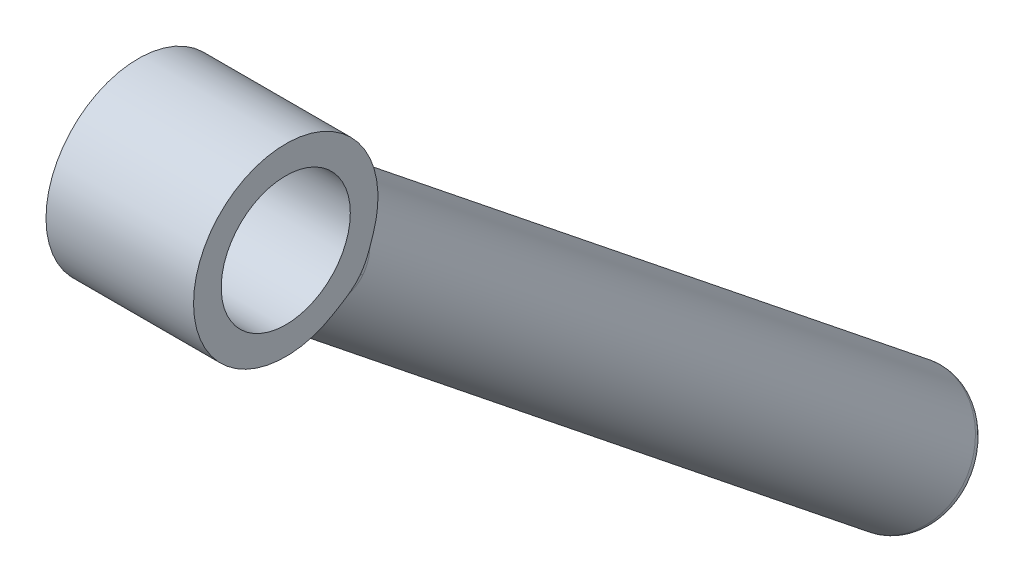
ISO-10303-21;
HEADER;
FILE_DESCRIPTION(('STEP AP214'),'2;1');
FILE_NAME('part.step','',(''),(''),'','','');
FILE_SCHEMA(('AUTOMOTIVE_DESIGN { 1 0 10303 214 1 1 1 1 }'));
ENDSEC;
DATA;
#1=APPLICATION_CONTEXT('core data for automotive mechanical design processes');
#2=APPLICATION_PROTOCOL_DEFINITION('international standard','automotive_design',2000,#1);
#3=PRODUCT_CONTEXT('',#1,'mechanical');
#4=PRODUCT('Part','Part','',(#3));
#5=PRODUCT_RELATED_PRODUCT_CATEGORY('part','',(#4));
#6=PRODUCT_DEFINITION_FORMATION('','',#4);
#7=PRODUCT_DEFINITION_CONTEXT('part definition',#1,'design');
#8=PRODUCT_DEFINITION('design','',#6,#7);
#9=PRODUCT_DEFINITION_SHAPE('','',#8);
#10=(LENGTH_UNIT() NAMED_UNIT(*) SI_UNIT(.MILLI.,.METRE.));
#11=(NAMED_UNIT(*) PLANE_ANGLE_UNIT() SI_UNIT($,.RADIAN.));
#12=(NAMED_UNIT(*) SI_UNIT($,.STERADIAN.) SOLID_ANGLE_UNIT());
#13=UNCERTAINTY_MEASURE_WITH_UNIT(LENGTH_MEASURE(1.E-05),#10,'distance_accuracy_value','');
#14=(GEOMETRIC_REPRESENTATION_CONTEXT(3) GLOBAL_UNCERTAINTY_ASSIGNED_CONTEXT((#13)) GLOBAL_UNIT_ASSIGNED_CONTEXT((#10,
#11,#12)) REPRESENTATION_CONTEXT('',''));
#15=CARTESIAN_POINT('',(0.,0.,0.));
#16=DIRECTION('',(0.,0.,1.));
#17=DIRECTION('',(1.,0.,0.));
#18=AXIS2_PLACEMENT_3D('',#15,#16,#17);
#19=CARTESIAN_POINT('',(0.,966.608585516,1208.07951372));
#20=DIRECTION('',(0.,-0.624752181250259,-0.780823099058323));
#21=DIRECTION('',(0.,0.780823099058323,-0.624752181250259));
#22=AXIS2_PLACEMENT_3D('',#19,#20,#21);
#23=PLANE('',#22);
#24=CARTESIAN_POINT('',(38.5886120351,383.173218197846,1674.89782222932));
#25=DIRECTION('',(0.,-0.624752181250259,-0.780823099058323));
#26=DIRECTION('',(0.,0.780823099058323,-0.624752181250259));
#27=AXIS2_PLACEMENT_3D('',#24,#25,#26);
#28=CIRCLE('',#27,10.);
#29=CARTESIAN_POINT('',(38.5886120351,390.981449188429,1668.65030041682));
#30=VERTEX_POINT('',#29);
#31=EDGE_CURVE('E250',#30,#30,#28,.T.);
#32=ORIENTED_EDGE('',*,*,#31,.T.);
#33=EDGE_LOOP('',(#32));
#34=FACE_BOUND('',#33,.T.);
#35=ADVANCED_FACE('F16',(#34),#23,.T.);
#36=CARTESIAN_POINT('',(38.5886120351,316.012358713,1590.95933908));
#37=DIRECTION('',(0.,-0.624752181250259,-0.780823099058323));
#38=DIRECTION('',(0.,0.780823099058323,-0.624752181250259));
#39=AXIS2_PLACEMENT_3D('',#36,#37,#38);
#40=CYLINDRICAL_SURFACE('',#39,10.);
#41=ORIENTED_EDGE('',*,*,#31,.F.);
#42=EDGE_LOOP('',(#41));
#43=FACE_BOUND('',#42,.T.);
#44=CARTESIAN_POINT('',(38.5886120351,250.725755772,1509.36332523));
#45=DIRECTION('',(0.,-0.624752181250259,-0.780823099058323));
#46=DIRECTION('',(-0.994729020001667,-0.0800645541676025,0.064061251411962));
#47=AXIS2_PLACEMENT_3D('',#44,#45,#46);
#48=CIRCLE('',#47,10.);
#49=CARTESIAN_POINT('',(28.6413218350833,249.925110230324,1510.00393774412));
#50=VERTEX_POINT('',#49);
#51=EDGE_CURVE('E247',#50,#50,#48,.F.);
#52=ORIENTED_EDGE('',*,*,#51,.F.);
#53=EDGE_LOOP('',(#52));
#54=FACE_BOUND('',#53,.T.);
#55=ADVANCED_FACE('F337',(#43,#54),#40,.F.);
#56=CARTESIAN_POINT('',(-56.4113879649,399.829040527,1695.71447754));
#57=DIRECTION('',(1.,0.,0.));
#58=DIRECTION('',(0.,0.,-1.));
#59=AXIS2_PLACEMENT_3D('',#56,#57,#58);
#60=CYLINDRICAL_SURFACE('',#59,17.5);
#61=CARTESIAN_POINT('',(58.5886120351,399.829040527,1695.71447754));
#62=DIRECTION('',(1.,0.,0.));
#63=DIRECTION('',(0.,0.,-1.));
#64=AXIS2_PLACEMENT_3D('',#61,#62,#63);
#65=CIRCLE('',#64,17.5);
#66=CARTESIAN_POINT('',(58.5886120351,399.829040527,1678.21447754));
#67=VERTEX_POINT('',#66);
#68=EDGE_CURVE('E253',#67,#67,#65,.T.);
#69=ORIENTED_EDGE('',*,*,#68,.T.);
#70=EDGE_LOOP('',(#69));
#71=FACE_BOUND('',#70,.T.);
#72=CARTESIAN_POINT('',(18.5886120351,399.829040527,1695.71447754));
#73=DIRECTION('',(1.,0.,0.));
#74=DIRECTION('',(0.,0.,-1.));
#75=AXIS2_PLACEMENT_3D('',#72,#73,#74);
#76=CIRCLE('',#75,17.5);
#77=CARTESIAN_POINT('',(18.5886120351,399.829040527,1678.21447754));
#78=VERTEX_POINT('',#77);
#79=EDGE_CURVE('E410',#78,#78,#76,.T.);
#80=ORIENTED_EDGE('',*,*,#79,.F.);
#81=EDGE_LOOP('',(#80));
#82=FACE_BOUND('',#81,.T.);
#83=ADVANCED_FACE('F330',(#71,#82),#60,.F.);
#84=CARTESIAN_POINT('',(38.5886120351,250.725755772,1509.36332523));
#85=DIRECTION('',(0.,-0.624752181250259,-0.780823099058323));
#86=DIRECTION('',(-0.994729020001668,-0.0800645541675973,0.0640612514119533));
#87=AXIS2_PLACEMENT_3D('',#84,#85,#86);
#88=TOROIDAL_SURFACE('',#87,13.,3.);
#89=CARTESIAN_POINT('',(38.5886120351,248.851499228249,1507.02085593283));
#90=DIRECTION('',(0.,-0.624752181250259,-0.780823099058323));
#91=DIRECTION('',(1.,9.43155809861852E-11,-7.54610049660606E-11));
#92=AXIS2_PLACEMENT_3D('',#89,#90,#91);
#93=CIRCLE('',#92,13.);
#94=CARTESIAN_POINT('',(25.5886120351,248.851499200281,1507.02085595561));
#95=VERTEX_POINT('',#94);
#96=CARTESIAN_POINT('',(51.5886120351,248.851499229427,1507.02085593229));
#97=VERTEX_POINT('',#96);
#98=EDGE_CURVE('E407',#95,#97,#93,.F.);
#99=ORIENTED_EDGE('',*,*,#98,.F.);
#100=CARTESIAN_POINT('',(38.5886120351,248.851499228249,1507.02085593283));
#101=DIRECTION('',(0.,-0.624752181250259,-0.780823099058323));
#102=DIRECTION('',(-1.,0.,0.));
#103=AXIS2_PLACEMENT_3D('',#100,#101,#102);
#104=CIRCLE('',#103,13.);
#105=EDGE_CURVE('E173',#97,#95,#104,.F.);
#106=ORIENTED_EDGE('',*,*,#105,.F.);
#107=EDGE_LOOP('',(#99,#106));
#108=FACE_BOUND('',#107,.T.);
#109=ORIENTED_EDGE('',*,*,#51,.T.);
#110=EDGE_LOOP('',(#109));
#111=FACE_BOUND('',#110,.T.);
#112=ADVANCED_FACE('F323',(#108,#111),#88,.T.);
#113=CARTESIAN_POINT('',(38.5886120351,399.829040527,1695.71447754));
#114=DIRECTION('',(-1.,0.,0.));
#115=DIRECTION('',(0.,0.,1.));
#116=AXIS2_PLACEMENT_3D('',#113,#114,#115);
#117=CYLINDRICAL_SURFACE('',#116,25.);
#118=CARTESIAN_POINT('',(58.5886120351,399.829040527,1695.71447754));
#119=DIRECTION('',(-1.,0.,0.));
#120=DIRECTION('',(0.,0.,1.));
#121=AXIS2_PLACEMENT_3D('',#118,#119,#120);
#122=CIRCLE('',#121,25.);
#123=CARTESIAN_POINT('',(58.5886115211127,378.454015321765,1682.74881885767));
#124=VERTEX_POINT('',#123);
#125=CARTESIAN_POINT('',(58.5886115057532,391.868227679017,1672.01583903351));
#126=VERTEX_POINT('',#125);
#127=EDGE_CURVE('E249',#124,#126,#122,.T.);
#128=ORIENTED_EDGE('',*,*,#127,.T.);
#129=CARTESIAN_POINT('',(18.5886120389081,391.868211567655,1672.01577910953));
#130=CARTESIAN_POINT('',(18.7309020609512,392.1004262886,1671.93779215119));
#131=CARTESIAN_POINT('',(18.8780100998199,392.331103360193,1671.86411798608));
#132=CARTESIAN_POINT('',(19.1814113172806,392.789159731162,1671.72494331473));
#133=CARTESIAN_POINT('',(19.3377121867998,393.016536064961,1671.65944979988));
#134=CARTESIAN_POINT('',(19.6589594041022,393.467590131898,1671.53625622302));
#135=CARTESIAN_POINT('',(19.8239139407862,393.691264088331,1671.47856373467));
#136=CARTESIAN_POINT('',(20.1620182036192,394.134608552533,1671.37057634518));
#137=CARTESIAN_POINT('',(20.3351778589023,394.354273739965,1671.32029072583));
#138=CARTESIAN_POINT('',(20.6892923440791,394.789325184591,1671.22671267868));
#139=CARTESIAN_POINT('',(20.8702587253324,395.004704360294,1671.18343109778));
#140=CARTESIAN_POINT('',(21.2396140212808,395.430899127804,1671.10345166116));
#141=CARTESIAN_POINT('',(21.4280149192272,395.641706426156,1671.06676501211));
#142=CARTESIAN_POINT('',(21.8119084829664,396.058484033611,1670.9995743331));
#143=CARTESIAN_POINT('',(22.0074133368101,396.264444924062,1670.96908158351));
#144=CARTESIAN_POINT('',(22.4052259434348,396.671263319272,1670.91387922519));
#145=CARTESIAN_POINT('',(22.607546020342,396.872110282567,1670.88918081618));
#146=CARTESIAN_POINT('',(23.0187410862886,397.26843618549,1670.84516920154));
#147=CARTESIAN_POINT('',(23.2276285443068,397.463903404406,1670.82586702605));
#148=CARTESIAN_POINT('',(23.6517502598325,397.849201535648,1670.79224976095));
#149=CARTESIAN_POINT('',(23.8669971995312,398.039019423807,1670.77794548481));
#150=CARTESIAN_POINT('',(24.3036686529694,398.412741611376,1670.75392446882));
#151=CARTESIAN_POINT('',(24.5251061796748,398.596631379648,1670.74421830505));
#152=CARTESIAN_POINT('',(24.9740274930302,398.958205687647,1670.72899116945));
#153=CARTESIAN_POINT('',(25.2015247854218,399.13587388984,1670.72348052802));
#154=CARTESIAN_POINT('',(25.6624712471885,399.484693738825,1670.71623800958));
#155=CARTESIAN_POINT('',(25.8959346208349,399.655826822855,1670.71451620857));
#156=CARTESIAN_POINT('',(26.3687548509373,399.991240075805,1670.71443947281));
#157=CARTESIAN_POINT('',(26.6081268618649,400.155498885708,1670.71609433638));
#158=CARTESIAN_POINT('',(27.0927431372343,400.476798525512,1670.72235261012));
#159=CARTESIAN_POINT('',(27.3380038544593,400.63381436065,1670.72696551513));
#160=CARTESIAN_POINT('',(27.8344037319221,400.940225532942,1670.73871703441));
#161=CARTESIAN_POINT('',(28.085560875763,401.089591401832,1670.74586468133));
#162=CARTESIAN_POINT('',(28.5937420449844,401.380223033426,1670.76224178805));
#163=CARTESIAN_POINT('',(28.8507849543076,401.52145535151,1670.77147916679));
#164=CARTESIAN_POINT('',(29.3706912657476,401.795265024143,1670.7915742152));
#165=CARTESIAN_POINT('',(29.633573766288,401.927805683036,1670.80243818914));
#166=CARTESIAN_POINT('',(30.1650731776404,402.183613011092,1670.82531032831));
#167=CARTESIAN_POINT('',(30.4337088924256,402.306840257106,1670.83732291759));
#168=CARTESIAN_POINT('',(30.9765840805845,402.543348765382,1670.8620048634));
#169=CARTESIAN_POINT('',(31.250841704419,402.656588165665,1670.87467666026));
#170=CARTESIAN_POINT('',(31.8047807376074,402.872406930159,1670.9001813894));
#171=CARTESIAN_POINT('',(32.0844794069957,402.974942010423,1670.91301476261));
#172=CARTESIAN_POINT('',(32.6490661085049,403.168608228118,1670.93834271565));
#173=CARTESIAN_POINT('',(32.933970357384,403.259692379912,1670.95083574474));
#174=CARTESIAN_POINT('',(33.5086480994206,403.429682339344,1670.9749789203));
#175=CARTESIAN_POINT('',(33.798436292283,403.508539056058,1670.98662557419));
#176=CARTESIAN_POINT('',(34.3823897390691,403.65328638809,1671.00859224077));
#177=CARTESIAN_POINT('',(34.6765669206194,403.719129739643,1671.01890737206));
#178=CARTESIAN_POINT('',(35.2686638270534,403.837122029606,1671.03777502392));
#179=CARTESIAN_POINT('',(35.5665923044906,403.889228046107,1671.04632200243));
#180=CARTESIAN_POINT('',(36.1654333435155,403.979110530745,1671.06128067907));
#181=CARTESIAN_POINT('',(36.4663515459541,404.016850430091,1671.06768692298));
#182=CARTESIAN_POINT('',(37.0702951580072,404.077492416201,1671.0780722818));
#183=CARTESIAN_POINT('',(37.3733234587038,404.100366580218,1671.08204682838));
#184=CARTESIAN_POINT('',(37.9804985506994,404.130927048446,1671.0873742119));
#185=CARTESIAN_POINT('',(38.2846461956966,404.138596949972,1671.08872421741));
#186=CARTESIAN_POINT('',(38.8929570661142,404.1385918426,1671.08872344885));
#187=CARTESIAN_POINT('',(39.1971202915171,404.130916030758,1671.08737253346));
#188=CARTESIAN_POINT('',(39.8043185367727,404.100359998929,1671.08205178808));
#189=CARTESIAN_POINT('',(40.1073544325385,404.077496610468,1671.07808485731));
#190=CARTESIAN_POINT('',(40.7112812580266,404.016891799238,1671.06772399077));
#191=CARTESIAN_POINT('',(41.0121752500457,403.979179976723,1671.06133488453));
#192=CARTESIAN_POINT('',(41.6109464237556,403.889363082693,1671.04641658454));
#193=CARTESIAN_POINT('',(41.9088294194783,403.837295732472,1671.03789300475));
#194=CARTESIAN_POINT('',(42.5008435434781,403.719377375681,1671.01907145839));
#195=CARTESIAN_POINT('',(42.794983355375,403.65356897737,1671.00877899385));
#196=CARTESIAN_POINT('',(43.3789037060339,403.508870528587,1670.98684810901));
#197=CARTESIAN_POINT('',(43.6686956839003,403.430025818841,1670.97521439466));
#198=CARTESIAN_POINT('',(44.2434313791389,403.260016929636,1670.95107615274));
#199=CARTESIAN_POINT('',(44.5283890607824,403.168899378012,1670.93857500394));
#200=CARTESIAN_POINT('',(45.0930761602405,402.975135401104,1670.9132077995));
#201=CARTESIAN_POINT('',(45.3728217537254,402.872535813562,1670.90034337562));
#202=CARTESIAN_POINT('',(45.9268042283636,402.656595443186,1670.87477045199));
#203=CARTESIAN_POINT('',(46.2010590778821,402.543300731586,1670.86206152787));
#204=CARTESIAN_POINT('',(46.7438696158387,402.306723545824,1670.83731927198));
#205=CARTESIAN_POINT('',(47.0124444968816,402.183485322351,1670.82528331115));
#206=CARTESIAN_POINT('',(47.5437856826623,401.927710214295,1670.80239024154));
#207=CARTESIAN_POINT('',(47.8065716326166,401.795214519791,1670.79152839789));
#208=CARTESIAN_POINT('',(48.326295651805,401.521515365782,1670.77145172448));
#209=CARTESIAN_POINT('',(48.5832527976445,401.380348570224,1670.76223052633));
#210=CARTESIAN_POINT('',(49.0913196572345,401.08979641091,1670.74586296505));
#211=CARTESIAN_POINT('',(49.3424470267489,400.940442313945,1670.73870928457));
#212=CARTESIAN_POINT('',(49.8388556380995,400.63400782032,1670.7269356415));
#213=CARTESIAN_POINT('',(50.084153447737,400.476954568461,1670.7223073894));
#214=CARTESIAN_POINT('',(50.5688745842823,400.155561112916,1670.71602194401));
#215=CARTESIAN_POINT('',(50.8083137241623,399.991244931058,1670.71435561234));
#216=CARTESIAN_POINT('',(51.2812662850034,399.655721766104,1670.71441790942));
#217=CARTESIAN_POINT('',(51.5147949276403,399.484536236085,1670.71613666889));
#218=CARTESIAN_POINT('',(51.97584978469,399.135631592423,1670.7233811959));
#219=CARTESIAN_POINT('',(52.2033907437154,398.957931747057,1670.72889647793));
#220=CARTESIAN_POINT('',(52.6523664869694,398.596323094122,1670.74413760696));
#221=CARTESIAN_POINT('',(52.8738156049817,398.412431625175,1670.75385247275));
#222=CARTESIAN_POINT('',(53.3104750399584,398.038737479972,1670.77789071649));
#223=CARTESIAN_POINT('',(53.525699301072,397.848950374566,1670.79220275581));
#224=CARTESIAN_POINT('',(53.9497457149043,397.463741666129,1670.82583065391));
#225=CARTESIAN_POINT('',(54.1585813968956,397.26833395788,1670.8451349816));
#226=CARTESIAN_POINT('',(54.5696549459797,396.872145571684,1670.88914316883));
#227=CARTESIAN_POINT('',(54.7719058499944,396.671377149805,1670.91383550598));
#228=CARTESIAN_POINT('',(55.1695796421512,396.264719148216,1670.96901844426));
#229=CARTESIAN_POINT('',(55.3650149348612,396.058840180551,1670.99949778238));
#230=CARTESIAN_POINT('',(55.748793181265,395.642208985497,1671.06666086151));
#231=CARTESIAN_POINT('',(55.9371476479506,395.431465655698,1671.10333394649));
#232=CARTESIAN_POINT('',(56.3064614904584,395.0053448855,1671.18329545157));
#233=CARTESIAN_POINT('',(56.4874309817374,394.789974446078,1671.22657440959));
#234=CARTESIAN_POINT('',(56.8416079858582,394.354869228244,1671.32015608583));
#235=CARTESIAN_POINT('',(57.0148246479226,394.135140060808,1671.37045022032));
#236=CARTESIAN_POINT('',(57.3530585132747,393.691639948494,1671.47846345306));
#237=CARTESIAN_POINT('',(57.5180847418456,393.467873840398,1671.53617411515));
#238=CARTESIAN_POINT('',(57.8394437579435,393.016667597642,1671.65941063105));
#239=CARTESIAN_POINT('',(57.995786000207,392.789231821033,1671.72492773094));
#240=CARTESIAN_POINT('',(58.2992223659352,392.331116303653,1671.86414358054));
#241=CARTESIAN_POINT('',(58.4463265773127,392.100440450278,1671.93783315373));
#242=CARTESIAN_POINT('',(58.5886104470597,391.868227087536,1672.01583888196));
#243=B_SPLINE_CURVE_WITH_KNOTS('',3,(#129,#130,#131,#132,#133,#134,#135,#136,#137,#138,#139,
#140,#141,#142,#143,#144,#145,#146,#147,#148,#149,#150,#151,#152,#153,#154,#155,#156,#157,#158,
#159,#160,#161,#162,#163,#164,#165,#166,#167,#168,#169,#170,#171,#172,#173,#174,#175,#176,#177,
#178,#179,#180,#181,#182,#183,#184,#185,#186,#187,#188,#189,#190,#191,#192,#193,#194,#195,#196,
#197,#198,#199,#200,#201,#202,#203,#204,#205,#206,#207,#208,#209,#210,#211,#212,#213,#214,#215,
#216,#217,#218,#219,#220,#221,#222,#223,#224,#225,#226,#227,#228,#229,#230,#231,#232,#233,#234,
#235,#236,#237,#238,#239,#240,#241,#242),.UNSPECIFIED.,.F.,.F.,(4,2,2,2,2,2,2,2,2,2,2,2,2,2,2,2,
2,2,2,2,2,2,2,2,2,2,2,2,2,2,2,2,2,2,2,2,2,2,2,2,2,2,2,2,2,2,2,2,2,2,2,2,2,2,2,2,4),(0.,
0.849745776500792,1.70021287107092,2.5514998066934,3.40384460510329,4.25749702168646,
5.11258660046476,5.96921977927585,6.82749532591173,7.68751261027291,8.54937927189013,
9.41321879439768,10.2791784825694,11.1474383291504,12.0182212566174,12.89181334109,
13.7685503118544,14.6486670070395,15.5322876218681,16.4194603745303,17.3101904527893,
18.2044705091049,19.1023078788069,20.0036614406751,20.9082308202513,21.8155938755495,
22.7252514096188,23.6366126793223,24.5489566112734,25.4613482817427,26.3727304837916,
27.2823049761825,28.1895118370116,29.0939463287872,29.995298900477,30.8933188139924,
31.7878005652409,32.6785911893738,33.5656157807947,34.4489181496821,35.3287132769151,
36.2053553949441,37.0791024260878,37.9501489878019,38.8186597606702,39.6847813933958,
40.5486518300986,41.4104077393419,42.2701906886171,43.1281526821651,43.9844616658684,
44.8393121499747,45.6929494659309,46.5455512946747,47.3971917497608,48.2478860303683,
49.0976345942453),.UNSPECIFIED.);
#244=CARTESIAN_POINT('',(18.5886120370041,391.868221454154,1672.01580854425));
#245=VERTEX_POINT('',#244);
#246=EDGE_CURVE('E242',#245,#126,#243,.T.);
#247=ORIENTED_EDGE('',*,*,#246,.F.);
#248=CARTESIAN_POINT('',(18.5886120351,399.829040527,1695.71447754));
#249=DIRECTION('',(-1.,0.,0.));
#250=DIRECTION('',(0.,0.,1.));
#251=AXIS2_PLACEMENT_3D('',#248,#249,#250);
#252=CIRCLE('',#251,25.);
#253=CARTESIAN_POINT('',(18.5886125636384,378.454015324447,1682.74881882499));
#254=VERTEX_POINT('',#253);
#255=EDGE_CURVE('E91',#254,#245,#252,.T.);
#256=ORIENTED_EDGE('',*,*,#255,.F.);
#257=CARTESIAN_POINT('',(61.0886120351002,384.210235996,1676.19390006));
#258=CARTESIAN_POINT('',(61.0886120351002,383.061170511,1677.11329034));
#259=CARTESIAN_POINT('',(60.9153616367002,381.979754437,1678.11722907));
#260=CARTESIAN_POINT('',(60.5689175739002,380.997449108,1679.18054112));
#261=CARTESIAN_POINT('',(59.6254618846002,379.33382841,1681.25745951));
#262=CARTESIAN_POINT('',(58.2217021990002,378.053839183,1683.35247223));
#263=CARTESIAN_POINT('',(57.4666928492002,377.529424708,1684.33625505));
#264=CARTESIAN_POINT('',(55.5316411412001,376.481594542,1686.57974441));
#265=CARTESIAN_POINT('',(53.2326078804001,375.79985726,1688.65712063));
#266=CARTESIAN_POINT('',(51.8161106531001,375.509445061,1689.77147373));
#267=CARTESIAN_POINT('',(48.6037209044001,375.066991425,1691.9443026));
#268=CARTESIAN_POINT('',(44.9561936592,374.904998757,1693.54506874));
#269=CARTESIAN_POINT('',(42.9007255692,374.873051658,1694.19077027));
#270=CARTESIAN_POINT('',(38.5885518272,374.842426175,1694.84310998));
#271=CARTESIAN_POINT('',(34.2763649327,374.873053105,1694.19074007));
#272=CARTESIAN_POINT('',(32.2209034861,374.905001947,1693.54502396));
#273=CARTESIAN_POINT('',(28.5733652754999,375.067001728,1691.94422714));
#274=CARTESIAN_POINT('',(25.3609948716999,375.509466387,1689.77138477));
#275=CARTESIAN_POINT('',(23.9444935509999,375.799886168,1688.65701913));
#276=CARTESIAN_POINT('',(21.6454713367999,376.481637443,1686.5796322));
#277=CARTESIAN_POINT('',(19.7104358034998,377.529485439,1684.33613581));
#278=CARTESIAN_POINT('',(18.9554402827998,378.053903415,1683.35235902));
#279=CARTESIAN_POINT('',(17.5517533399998,379.333857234,1681.25742892));
#280=CARTESIAN_POINT('',(16.6083405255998,380.997412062,1679.18059704));
#281=CARTESIAN_POINT('',(16.2618367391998,381.979746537,1678.11721236));
#282=CARTESIAN_POINT('',(16.0886123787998,383.061264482,1677.11321526));
#283=CARTESIAN_POINT('',(16.0886120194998,384.21023596,1676.19390009));
#284=B_SPLINE_CURVE_WITH_KNOTS('',5,(#257,#258,#259,#260,#261,#262,#263,#264,#265,#266,#267,
#268,#269,#270,#271,#272,#273,#274,#275,#276,#277,#278,#279,#280,#281,#282,#283),.UNSPECIFIED.,
.F.,.F.,(6,3,3,3,3,3,3,3,6),(0.,10.0649569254,19.164568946,31.3199951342,44.9773265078,
58.6346730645,70.7901446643,79.8897263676,89.9539416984),.UNSPECIFIED.);
#285=EDGE_CURVE('E83',#124,#254,#284,.T.);
#286=ORIENTED_EDGE('',*,*,#285,.F.);
#287=EDGE_LOOP('',(#128,#247,#256,#286));
#288=FACE_BOUND('',#287,.T.);
#289=ADVANCED_FACE('F230',(#288),#117,.T.);
#290=CARTESIAN_POINT('',(58.5886120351,0.,0.));
#291=DIRECTION('',(-1.,0.,0.));
#292=DIRECTION('',(0.,0.,1.));
#293=AXIS2_PLACEMENT_3D('',#290,#291,#292);
#294=PLANE('',#293);
#295=ORIENTED_EDGE('',*,*,#68,.F.);
#296=EDGE_LOOP('',(#295));
#297=FACE_BOUND('',#296,.T.);
#298=ORIENTED_EDGE('',*,*,#127,.F.);
#299=CARTESIAN_POINT('',(58.5886120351,383.791730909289,1675.67084716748));
#300=CARTESIAN_POINT('',(58.5886120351,383.642683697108,1675.79005734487));
#301=CARTESIAN_POINT('',(58.5886120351,383.496393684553,1675.9126961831));
#302=CARTESIAN_POINT('',(58.5886120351,383.209833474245,1676.16406096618));
#303=CARTESIAN_POINT('',(58.5886120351,383.069548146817,1676.29276965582));
#304=CARTESIAN_POINT('',(58.5886120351,382.794892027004,1676.55596561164));
#305=CARTESIAN_POINT('',(58.5886120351,382.660513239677,1676.69044454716));
#306=CARTESIAN_POINT('',(58.5886120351,382.397432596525,1676.96474406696));
#307=CARTESIAN_POINT('',(58.5886120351,382.26872873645,1677.10456273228));
#308=CARTESIAN_POINT('',(58.5886120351,382.017686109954,1677.3879144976));
#309=CARTESIAN_POINT('',(58.5886120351,381.895306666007,1677.53141163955));
#310=CARTESIAN_POINT('',(58.5886120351,381.655488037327,1677.82258814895));
#311=CARTESIAN_POINT('',(58.5886120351,381.538051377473,1677.97026959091));
#312=CARTESIAN_POINT('',(58.5886120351,381.307705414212,1678.26920987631));
#313=CARTESIAN_POINT('',(58.5886120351,381.194798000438,1678.42047017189));
#314=CARTESIAN_POINT('',(58.5886120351,380.973059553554,1678.72593516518));
#315=CARTESIAN_POINT('',(58.5886120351,380.86422840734,1678.88013978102));
#316=CARTESIAN_POINT('',(58.5886120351,380.654221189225,1679.1849602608));
#317=CARTESIAN_POINT('',(58.5886120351,380.552911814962,1679.33548456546));
#318=CARTESIAN_POINT('',(58.5886120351,380.353050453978,1679.63828915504));
#319=CARTESIAN_POINT('',(58.5886120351,380.254497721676,1679.7905689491));
#320=CARTESIAN_POINT('',(58.5886120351,380.059587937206,1680.09651965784));
#321=CARTESIAN_POINT('',(58.5886120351,379.963230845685,1680.25019054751));
#322=CARTESIAN_POINT('',(58.5886120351,379.772161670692,1680.55856596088));
#323=CARTESIAN_POINT('',(58.5886120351,379.677449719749,1680.71327056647));
#324=CARTESIAN_POINT('',(58.5886120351,379.488390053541,1681.02458067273));
#325=CARTESIAN_POINT('',(58.5886120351,379.394051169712,1681.18119152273));
#326=CARTESIAN_POINT('',(58.5886120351,379.205949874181,1681.49475085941));
#327=CARTESIAN_POINT('',(58.5886120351,379.112187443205,1681.65169933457));
#328=CARTESIAN_POINT('',(58.5886120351,378.924698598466,1681.96558148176));
#329=CARTESIAN_POINT('',(58.5886120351,378.830972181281,1682.1225151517));
#330=CARTESIAN_POINT('',(58.5886120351,378.643016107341,1682.43601389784));
#331=CARTESIAN_POINT('',(58.5886120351,378.548786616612,1682.59257907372));
#332=CARTESIAN_POINT('',(58.5886120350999,378.454015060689,1682.7488186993));
#333=B_SPLINE_CURVE_WITH_KNOTS('',3,(#299,#300,#301,#302,#303,#304,#305,#306,#307,#308,#309,
#310,#311,#312,#313,#314,#315,#316,#317,#318,#319,#320,#321,#322,#323,#324,#325,#326,#327,#328,
#329,#330,#331,#332),.UNSPECIFIED.,.F.,.F.,(4,2,2,2,2,2,2,2,2,2,2,2,2,2,2,2,4),(0.,
0.57250167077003,1.14346386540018,1.71362779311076,2.28358871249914,2.84925190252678,
3.41520062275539,3.98138305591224,4.54754976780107,5.0918402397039,5.63598204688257,
6.1801140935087,6.72428977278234,7.27277700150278,7.82124579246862,8.36962024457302,
8.91782370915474),.UNSPECIFIED.);
#334=CARTESIAN_POINT('',(58.5886122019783,383.791730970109,1675.67084724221));
#335=VERTEX_POINT('',#334);
#336=EDGE_CURVE('E73',#335,#124,#333,.T.);
#337=ORIENTED_EDGE('',*,*,#336,.F.);
#338=CARTESIAN_POINT('',(58.5886120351,391.868227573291,1672.01583871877));
#339=CARTESIAN_POINT('',(58.5886120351,391.632236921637,1672.09511157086));
#340=CARTESIAN_POINT('',(58.5886120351,391.395879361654,1672.17327038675));
#341=CARTESIAN_POINT('',(58.5886120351,390.923561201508,1672.32870039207));
#342=CARTESIAN_POINT('',(58.5886120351,390.687601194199,1672.40597337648));
#343=CARTESIAN_POINT('',(58.5886120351,390.216607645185,1672.56116025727));
#344=CARTESIAN_POINT('',(58.5886120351,389.981573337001,1672.63907181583));
#345=CARTESIAN_POINT('',(58.5886120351,389.512952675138,1672.79705267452));
#346=CARTESIAN_POINT('',(58.5886120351,389.279364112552,1672.87711537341));
#347=CARTESIAN_POINT('',(58.5886120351,388.814159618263,1673.04092215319));
#348=CARTESIAN_POINT('',(58.5886120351,388.58254012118,1673.12465603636));
#349=CARTESIAN_POINT('',(58.5886120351,388.121803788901,1673.29734475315));
#350=CARTESIAN_POINT('',(58.5886120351,387.892682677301,1673.38628809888));
#351=CARTESIAN_POINT('',(58.5886120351,387.43589769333,1673.5715937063));
#352=CARTESIAN_POINT('',(58.5886120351,387.208249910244,1673.66799589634));
#353=CARTESIAN_POINT('',(58.5886120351,386.756871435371,1673.86914101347));
#354=CARTESIAN_POINT('',(58.5886120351,386.533137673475,1673.97387700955));
#355=CARTESIAN_POINT('',(58.5886120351,386.090381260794,1674.1931010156));
#356=CARTESIAN_POINT('',(58.5886120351,385.871360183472,1674.30759222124));
#357=CARTESIAN_POINT('',(58.5886120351,385.438769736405,1674.54762178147));
#358=CARTESIAN_POINT('',(58.5886120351,385.225214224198,1674.67318519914));
#359=CARTESIAN_POINT('',(58.5886120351,384.804186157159,1674.93650396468));
#360=CARTESIAN_POINT('',(58.5886120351,384.596750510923,1675.07431866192));
#361=CARTESIAN_POINT('',(58.5886120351,384.291015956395,1675.29051556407));
#362=CARTESIAN_POINT('',(58.5886120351,384.18958420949,1675.36449846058));
#363=CARTESIAN_POINT('',(58.5886120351,383.988954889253,1675.51544461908));
#364=CARTESIAN_POINT('',(58.5886120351,383.889757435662,1675.5924080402));
#365=CARTESIAN_POINT('',(58.5886120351,383.791730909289,1675.67084716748));
#366=B_SPLINE_CURVE_WITH_KNOTS('',3,(#338,#339,#340,#341,#342,#343,#344,#345,#346,#347,#348,
#349,#350,#351,#352,#353,#354,#355,#356,#357,#358,#359,#360,#361,#362,#363,#364,#365),
.UNSPECIFIED.,.F.,.F.,(4,2,2,2,2,2,2,2,2,2,2,2,2,4),(0.,0.746837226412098,1.49170850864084,
2.23453773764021,2.97530173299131,3.71412440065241,4.45137504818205,5.19288913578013,
5.93379284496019,6.67494020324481,7.41781054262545,8.16449924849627,8.54108942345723,
8.91769973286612),.UNSPECIFIED.);
#367=EDGE_CURVE('E100',#126,#335,#366,.T.);
#368=ORIENTED_EDGE('',*,*,#367,.F.);
#369=EDGE_LOOP('',(#298,#337,#368));
#370=FACE_BOUND('',#369,.T.);
#371=ADVANCED_FACE('F227',(#297,#370),#294,.F.);
#372=CARTESIAN_POINT('',(18.5886120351,0.,0.));
#373=DIRECTION('',(-1.,0.,0.));
#374=DIRECTION('',(0.,0.,1.));
#375=AXIS2_PLACEMENT_3D('',#372,#373,#374);
#376=PLANE('',#375);
#377=ORIENTED_EDGE('',*,*,#79,.T.);
#378=EDGE_LOOP('',(#377));
#379=FACE_BOUND('',#378,.T.);
#380=CARTESIAN_POINT('',(18.5886120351,378.454015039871,1682.74881865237));
#381=CARTESIAN_POINT('',(18.5886120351,378.583126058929,1682.53596632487));
#382=CARTESIAN_POINT('',(18.5886120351,378.711230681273,1682.32251164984));
#383=CARTESIAN_POINT('',(18.5886120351,378.966486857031,1681.89579487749));
#384=CARTESIAN_POINT('',(18.5886120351,379.093640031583,1681.68253375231));
#385=CARTESIAN_POINT('',(18.5886120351,379.348368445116,1681.25705599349));
#386=CARTESIAN_POINT('',(18.5886120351,379.475941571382,1681.04483809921));
#387=CARTESIAN_POINT('',(18.5886120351,379.73287538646,1680.6222883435));
#388=CARTESIAN_POINT('',(18.5886120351,379.862230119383,1680.41195287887));
#389=CARTESIAN_POINT('',(18.5886120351,380.124098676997,1679.99401418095));
#390=CARTESIAN_POINT('',(18.5886120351,380.256603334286,1679.78640523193));
#391=CARTESIAN_POINT('',(18.5886120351,380.526157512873,1679.37477440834));
#392=CARTESIAN_POINT('',(18.5886120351,380.663196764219,1679.17074584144));
#393=CARTESIAN_POINT('',(18.5886120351,380.944193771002,1678.76573797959));
#394=CARTESIAN_POINT('',(18.5886120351,381.088186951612,1678.56478314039));
#395=CARTESIAN_POINT('',(18.5886120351,381.383451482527,1678.16852474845));
#396=CARTESIAN_POINT('',(18.5886120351,381.534716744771,1677.97321668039));
#397=CARTESIAN_POINT('',(18.5886120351,381.845728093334,1677.5893360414));
#398=CARTESIAN_POINT('',(18.5886120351,382.005476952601,1677.40076570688));
#399=CARTESIAN_POINT('',(18.5886120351,382.334556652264,1677.03136722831));
#400=CARTESIAN_POINT('',(18.5886120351,382.503908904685,1676.85055810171));
#401=CARTESIAN_POINT('',(18.5886120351,382.853173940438,1676.49754915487));
#402=CARTESIAN_POINT('',(18.5886120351,383.033136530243,1676.32539836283));
#403=CARTESIAN_POINT('',(18.5886120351,383.311135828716,1676.07453767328));
#404=CARTESIAN_POINT('',(18.5886120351,383.405567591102,1675.99180613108));
#405=CARTESIAN_POINT('',(18.5886120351,383.596848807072,1675.82917663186));
#406=CARTESIAN_POINT('',(18.5886120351,383.693698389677,1675.7492788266));
#407=CARTESIAN_POINT('',(18.5886120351,383.791730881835,1675.67084716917));
#408=B_SPLINE_CURVE_WITH_KNOTS('',3,(#380,#381,#382,#383,#384,#385,#386,#387,#388,#389,#390,
#391,#392,#393,#394,#395,#396,#397,#398,#399,#400,#401,#402,#403,#404,#405,#406,#407),
.UNSPECIFIED.,.F.,.F.,(4,2,2,2,2,2,2,2,2,2,2,2,2,4),(0.,0.746837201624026,1.49170847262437,
2.23453770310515,2.97530171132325,3.71412440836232,4.45137511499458,5.19288913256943,
5.93379282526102,6.6749401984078,7.41781052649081,8.16449917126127,8.54108931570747,
8.91769959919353),.UNSPECIFIED.);
#409=CARTESIAN_POINT('',(18.5886120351,383.791730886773,1675.67084717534));
#410=VERTEX_POINT('',#409);
#411=EDGE_CURVE('E77',#254,#410,#408,.T.);
#412=ORIENTED_EDGE('',*,*,#411,.F.);
#413=ORIENTED_EDGE('',*,*,#255,.T.);
#414=CARTESIAN_POINT('',(18.5886120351,383.791730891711,1675.67084718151));
#415=CARTESIAN_POINT('',(18.5886120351,383.940707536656,1675.55160150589));
#416=CARTESIAN_POINT('',(18.5886120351,384.092422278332,1675.43579485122));
#417=CARTESIAN_POINT('',(18.5886120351,384.400467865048,1675.21138763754));
#418=CARTESIAN_POINT('',(18.5886120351,384.5567851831,1675.10276851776));
#419=CARTESIAN_POINT('',(18.5886120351,384.873760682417,1674.8925694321));
#420=CARTESIAN_POINT('',(18.5886120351,385.034412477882,1674.79097982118));
#421=CARTESIAN_POINT('',(18.5886120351,385.359682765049,1674.5945118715));
#422=CARTESIAN_POINT('',(18.5886120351,385.524299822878,1674.49963115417));
#423=CARTESIAN_POINT('',(18.5886120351,385.855761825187,1674.31689365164));
#424=CARTESIAN_POINT('',(18.5886120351,386.022580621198,1674.22898931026));
#425=CARTESIAN_POINT('',(18.5886120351,386.35921374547,1674.05891542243));
#426=CARTESIAN_POINT('',(18.5886120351,386.529029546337,1673.97674879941));
#427=CARTESIAN_POINT('',(18.5886120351,386.8711566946,1673.81761346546));
#428=CARTESIAN_POINT('',(18.5886120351,387.043469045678,1673.74064691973));
#429=CARTESIAN_POINT('',(18.5886120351,387.390070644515,1673.59133255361));
#430=CARTESIAN_POINT('',(18.5886120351,387.564359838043,1673.51898460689));
#431=CARTESIAN_POINT('',(18.5886120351,387.907817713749,1673.3809423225));
#432=CARTESIAN_POINT('',(18.5886120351,388.076926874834,1673.31509928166));
#433=CARTESIAN_POINT('',(18.5886120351,388.416253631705,1673.18648869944));
#434=CARTESIAN_POINT('',(18.5886120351,388.586470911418,1673.12372032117));
#435=CARTESIAN_POINT('',(18.5886120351,388.927781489,1673.00063199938));
#436=CARTESIAN_POINT('',(18.5886120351,389.098874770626,1672.94031201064));
#437=CARTESIAN_POINT('',(18.5886120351,389.441709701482,1672.82150578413));
#438=CARTESIAN_POINT('',(18.5886120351,389.613451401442,1672.76301969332));
#439=CARTESIAN_POINT('',(18.5886120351,389.958710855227,1672.64682259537));
#440=CARTESIAN_POINT('',(18.5886120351,390.13223189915,1672.58912140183));
#441=CARTESIAN_POINT('',(18.5886120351,390.479478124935,1672.47435886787));
#442=CARTESIAN_POINT('',(18.5886120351,390.653203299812,1672.41729750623));
#443=CARTESIAN_POINT('',(18.5886120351,391.000632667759,1672.3032105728));
#444=CARTESIAN_POINT('',(18.5886120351,391.174336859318,1672.24618499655));
#445=CARTESIAN_POINT('',(18.5886120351,391.521497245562,1672.13156545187));
#446=CARTESIAN_POINT('',(18.5886120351,391.694953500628,1672.07397166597));
#447=CARTESIAN_POINT('',(18.5886120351,391.868211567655,1672.01577910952));
#448=B_SPLINE_CURVE_WITH_KNOTS('',3,(#414,#415,#416,#417,#418,#419,#420,#421,#422,#423,#424,
#425,#426,#427,#428,#429,#430,#431,#432,#433,#434,#435,#436,#437,#438,#439,#440,#441,#442,#443,
#444,#445,#446,#447),.UNSPECIFIED.,.F.,.F.,(4,2,2,2,2,2,2,2,2,2,2,2,2,2,2,2,4),(0.,
0.572403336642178,1.14326566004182,1.71332851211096,2.28318823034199,2.84875223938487,
3.41460233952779,3.98068661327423,4.54675539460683,5.09114555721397,5.63538670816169,
6.17961780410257,6.7238923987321,7.2724796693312,7.82104868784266,8.3695236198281,
8.91782776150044),.UNSPECIFIED.);
#449=EDGE_CURVE('E89',#410,#245,#448,.T.);
#450=ORIENTED_EDGE('',*,*,#449,.F.);
#451=EDGE_LOOP('',(#412,#413,#450));
#452=FACE_BOUND('',#451,.T.);
#453=ADVANCED_FACE('F90',(#379,#452),#376,.T.);
#454=CARTESIAN_POINT('',(61.16715185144,384.210235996,1676.19390006));
#455=CARTESIAN_POINT('',(61.151443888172,384.210235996,1676.19390006));
#456=CARTESIAN_POINT('',(61.135735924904,384.210235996,1676.19390006));
#457=CARTESIAN_POINT('',(61.120027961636,384.210235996,1676.19390006));
#458=CARTESIAN_POINT('',(61.104319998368,384.210235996,1676.19390006));
#459=CARTESIAN_POINT('',(61.0886120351,384.210235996,1676.19390006));
#460=CARTESIAN_POINT('',(60.3032138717,384.210235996,1676.19390006));
#461=CARTESIAN_POINT('',(59.5178032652,384.113912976,1676.07351435));
#462=CARTESIAN_POINT('',(58.772819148,383.921122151,1675.83256196));
#463=CARTESIAN_POINT('',(57.4440578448,383.36341827,1675.13553666));
#464=CARTESIAN_POINT('',(56.551377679,382.533271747,1674.09800915));
#465=CARTESIAN_POINT('',(56.2427899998,382.067841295,1673.51630834));
#466=CARTESIAN_POINT('',(56.0886120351,381.577154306,1672.9030416));
#467=CARTESIAN_POINT('',(56.0886120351,381.08647509,1672.28978457));
#468=CARTESIAN_POINT('',(61.16715185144,383.0563573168,1677.117141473));
#469=CARTESIAN_POINT('',(61.151443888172,383.05731995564,1677.1163712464));
#470=CARTESIAN_POINT('',(61.135735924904,383.05828259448,1677.1156010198));
#471=CARTESIAN_POINT('',(61.120027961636,383.05924523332,1677.1148307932));
#472=CARTESIAN_POINT('',(61.104319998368,383.06020787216,1677.1140605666));
#473=CARTESIAN_POINT('',(61.0886120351,383.061170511,1677.11329034));
#474=CARTESIAN_POINT('',(60.3032138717,383.109302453,1677.07477901));
#475=CARTESIAN_POINT('',(59.5178032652,383.054025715,1676.92155135));
#476=CARTESIAN_POINT('',(58.772819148,382.89270662,1676.6554178));
#477=CARTESIAN_POINT('',(57.4440578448,382.375403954,1675.92606668));
#478=CARTESIAN_POINT('',(56.551377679,381.53889064,1674.89363336));
#479=CARTESIAN_POINT('',(56.2427899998,381.058130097,1674.32419847));
#480=CARTESIAN_POINT('',(56.0886120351,380.540792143,1673.73225569));
#481=CARTESIAN_POINT('',(56.0886120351,380.01401397,1673.14788216));
#482=CARTESIAN_POINT('',(60.99271973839,381.9706875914,1678.125644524));
#483=CARTESIAN_POINT('',(60.977248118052,381.97250096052,1678.1239614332));
#484=CARTESIAN_POINT('',(60.961776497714,381.97431432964,1678.1222783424));
#485=CARTESIAN_POINT('',(60.946304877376,381.97612769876,1678.1205952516));
#486=CARTESIAN_POINT('',(60.930833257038,381.97794106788,1678.1189121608));
#487=CARTESIAN_POINT('',(60.9153616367,381.979754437,1678.11722907));
#488=CARTESIAN_POINT('',(60.1417806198,382.070422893,1678.03307453));
#489=CARTESIAN_POINT('',(59.3681878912,382.0524223,1677.84216796));
#490=CARTESIAN_POINT('',(58.6338177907,381.920919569,1677.54869147));
#491=CARTESIAN_POINT('',(57.3214988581,381.444787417,1676.78788046));
#492=CARTESIAN_POINT('',(56.432983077,380.609341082,1675.76992012));
#493=CARTESIAN_POINT('',(56.1227135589,380.118269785,1675.21911557));
#494=CARTESIAN_POINT('',(55.9629241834,379.57994964,1674.65570913));
#495=CARTESIAN_POINT('',(55.9538617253,379.022731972,1674.10743803));
#496=CARTESIAN_POINT('',(60.64390606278,380.9852569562,1679.193789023));
#497=CARTESIAN_POINT('',(60.628908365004,380.98769538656,1679.1911394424));
#498=CARTESIAN_POINT('',(60.613910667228,380.99013381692,1679.1884898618));
#499=CARTESIAN_POINT('',(60.598912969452,380.99257224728,1679.1858402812));
#500=CARTESIAN_POINT('',(60.583915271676,380.99501067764,1679.1831907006));
#501=CARTESIAN_POINT('',(60.5689175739,380.997449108,1679.18054112));
#502=CARTESIAN_POINT('',(59.8190326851,381.119370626,1679.04806209));
#503=CARTESIAN_POINT('',(59.069137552,381.129959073,1678.81849525));
#504=CARTESIAN_POINT('',(58.356047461,381.022989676,1678.49836849));
#505=CARTESIAN_POINT('',(57.076677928,380.584824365,1677.71010842));
#506=CARTESIAN_POINT('',(56.1964575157,379.76064337,1676.71385815));
#507=CARTESIAN_POINT('',(55.8827781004,379.267401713,1676.18560742));
#508=CARTESIAN_POINT('',(55.7116902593,378.718372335,1675.6543327));
#509=CARTESIAN_POINT('',(55.6844050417,378.141992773,1675.1449547));
#510=CARTESIAN_POINT('',(59.69452886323,379.3178941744,1681.279246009));
#511=CARTESIAN_POINT('',(59.680715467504,379.32108102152,1681.2748887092));
#512=CARTESIAN_POINT('',(59.666902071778,379.32426786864,1681.2705314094));
#513=CARTESIAN_POINT('',(59.653088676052,379.32745471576,1681.2661741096));
#514=CARTESIAN_POINT('',(59.639275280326,379.33064156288,1681.2618168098));
#515=CARTESIAN_POINT('',(59.6254618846,379.33382841,1681.25745951));
#516=CARTESIAN_POINT('',(58.9347920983,379.493170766,1681.03959452));
#517=CARTESIAN_POINT('',(58.2441150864,379.540731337,1680.74392655));
#518=CARTESIAN_POINT('',(57.5845358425,379.469109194,1680.38045011));
#519=CARTESIAN_POINT('',(56.3894811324,379.09412516,1679.55242389));
#520=CARTESIAN_POINT('',(55.5347162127,378.308395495,1678.60282807));
#521=CARTESIAN_POINT('',(55.215613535,377.825796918,1678.11771881));
#522=CARTESIAN_POINT('',(55.0198716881,377.276179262,1677.64508293));
#523=CARTESIAN_POINT('',(54.9506065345,376.686301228,1677.20466977));
#524=CARTESIAN_POINT('',(58.28320700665,378.037512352,1683.380881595));
#525=CARTESIAN_POINT('',(58.27090604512,378.0407777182,1683.375199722));
#526=CARTESIAN_POINT('',(58.25860508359,378.0440430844,1683.369517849));
#527=CARTESIAN_POINT('',(58.24630412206,378.0473084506,1683.363835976));
#528=CARTESIAN_POINT('',(58.23400316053,378.0505738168,1683.358154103));
#529=CARTESIAN_POINT('',(58.221702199,378.053839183,1683.35247223));
#530=CARTESIAN_POINT('',(57.6066541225,378.217107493,1683.06837858));
#531=CARTESIAN_POINT('',(56.9916015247,378.275087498,1682.72510937));
#532=CARTESIAN_POINT('',(56.4011534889,378.221111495,1682.33415931));
#533=CARTESIAN_POINT('',(55.3184969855,377.89370162,1681.48964905));
#534=CARTESIAN_POINT('',(54.5079399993,377.169814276,1680.59004659));
#535=CARTESIAN_POINT('',(54.1897099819,376.719184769,1680.14398239));
#536=CARTESIAN_POINT('',(53.9718168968,376.198616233,1679.72020529));
#537=CARTESIAN_POINT('',(53.8587931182,375.630948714,1679.33411924));
#538=CARTESIAN_POINT('',(57.52445552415,377.5135081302,1684.367219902));
#539=CARTESIAN_POINT('',(57.51290298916,377.51669144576,1684.3610269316));
#540=CARTESIAN_POINT('',(57.50135045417,377.51987476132,1684.3548339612));
#541=CARTESIAN_POINT('',(57.48979791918,377.52305807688,1684.3486409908));
#542=CARTESIAN_POINT('',(57.47824538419,377.52624139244,1684.3424480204));
#543=CARTESIAN_POINT('',(57.4666928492,377.529424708,1684.33625505));
#544=CARTESIAN_POINT('',(56.8890660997,377.688590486,1684.02660653));
#545=CARTESIAN_POINT('',(56.3114358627,377.746758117,1683.66597897));
#546=CARTESIAN_POINT('',(55.7554330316,377.697873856,1683.2660885));
#547=CARTESIAN_POINT('',(54.7297995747,377.389797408,1682.41905423));
#548=CARTESIAN_POINT('',(53.9446336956,376.698851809,1681.54240347));
#549=CARTESIAN_POINT('',(53.6291904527,376.266949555,1681.1128865));
#550=CARTESIAN_POINT('',(53.4031837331,375.765390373,1680.70888245));
#551=CARTESIAN_POINT('',(53.2715636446,375.21488798,1680.34404375));
#552=CARTESIAN_POINT('',(55.58060226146,376.4674791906,1686.615397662));
#553=CARTESIAN_POINT('',(55.570810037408,376.47030226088,1686.6082670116));
#554=CARTESIAN_POINT('',(55.561017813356,376.47312533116,1686.6011363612));
#555=CARTESIAN_POINT('',(55.551225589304,376.47594840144,1686.5940057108));
#556=CARTESIAN_POINT('',(55.541433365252,376.47877147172,1686.5868750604));
#557=CARTESIAN_POINT('',(55.5316411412,376.481594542,1686.57974441));
#558=CARTESIAN_POINT('',(55.0420299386,376.622748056,1686.22321189));
#559=CARTESIAN_POINT('',(54.5524171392,376.674630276,1685.83287866));
#560=CARTESIAN_POINT('',(54.0780174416,376.632795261,1685.42018255));
#561=CARTESIAN_POINT('',(53.1900081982,376.364394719,1684.5770974));
#562=CARTESIAN_POINT('',(52.4736018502,375.754160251,1683.75134853));
#563=CARTESIAN_POINT('',(52.1708481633,375.370399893,1683.35599608));
#564=CARTESIAN_POINT('',(51.9333688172,374.920340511,1682.99096604));
#565=CARTESIAN_POINT('',(51.7665237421,374.419696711,1682.66641204));
#566=CARTESIAN_POINT('',(53.27286834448,375.7887667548,1688.694824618));
#567=CARTESIAN_POINT('',(53.264816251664,375.79098485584,1688.6872838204));
#568=CARTESIAN_POINT('',(53.256764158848,375.79320295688,1688.6797430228));
#569=CARTESIAN_POINT('',(53.248712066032,375.79542105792,1688.6722022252));
#570=CARTESIAN_POINT('',(53.240659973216,375.79763915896,1688.6646614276));
#571=CARTESIAN_POINT('',(53.2326078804,375.79985726,1688.65712063));
#572=CARTESIAN_POINT('',(52.8300032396,375.910762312,1688.28008075));
#573=CARTESIAN_POINT('',(52.4273978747,375.946411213,1687.88167424));
#574=CARTESIAN_POINT('',(52.0350356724,375.903980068,1687.47175297));
#575=CARTESIAN_POINT('',(51.2912558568,375.665237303,1686.65071756));
#576=CARTESIAN_POINT('',(50.6643506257,375.138459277,1685.86882656));
#577=CARTESIAN_POINT('',(50.3888828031,374.807941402,1685.49805755));
#578=CARTESIAN_POINT('',(50.1586608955,374.418953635,1685.15729234));
#579=CARTESIAN_POINT('',(49.9783863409,373.982686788,1684.8543573));
#580=CARTESIAN_POINT('',(51.85153911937,375.5001338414,1689.809657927));
#581=CARTESIAN_POINT('',(51.844453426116,375.50199608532,1689.8020210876));
#582=CARTESIAN_POINT('',(51.837367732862,375.50385832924,1689.7943842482));
#583=CARTESIAN_POINT('',(51.830282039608,375.50572057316,1689.7867474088));
#584=CARTESIAN_POINT('',(51.823196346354,375.50758281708,1689.7791105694));
#585=CARTESIAN_POINT('',(51.8161106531,375.509445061,1689.77147373));
#586=CARTESIAN_POINT('',(51.4618259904,375.602557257,1689.38963176));
#587=CARTESIAN_POINT('',(51.1075408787,375.628393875,1688.99191324));
#588=CARTESIAN_POINT('',(50.7612100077,375.584864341,1688.58710654));
#589=CARTESIAN_POINT('',(50.1003478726,375.361131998,1687.78229938));
#590=CARTESIAN_POINT('',(49.5307637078,374.880104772,1687.02293203));
#591=CARTESIAN_POINT('',(49.2757231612,374.57924404,1686.66357196));
#592=CARTESIAN_POINT('',(49.0563263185,374.224988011,1686.33294604));
#593=CARTESIAN_POINT('',(48.8766663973,373.826369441,1686.03781629));
#594=CARTESIAN_POINT('',(48.62912232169,375.0612198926,1691.982518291));
#595=CARTESIAN_POINT('',(48.624042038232,375.06237419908,1691.9748751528));
#596=CARTESIAN_POINT('',(48.618961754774,375.06352850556,1691.9672320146));
#597=CARTESIAN_POINT('',(48.613881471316,375.06468281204,1691.9595888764));
#598=CARTESIAN_POINT('',(48.608801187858,375.06583711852,1691.9519457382));
#599=CARTESIAN_POINT('',(48.6037209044,375.066991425,1691.9443026));
#600=CARTESIAN_POINT('',(48.3497067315,375.124706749,1691.56214569));
#601=CARTESIAN_POINT('',(48.0956924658,375.131014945,1691.17290279));
#602=CARTESIAN_POINT('',(47.8457533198,375.085010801,1690.78315684));
#603=CARTESIAN_POINT('',(47.3621719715,374.890006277,1690.01622703));
#604=CARTESIAN_POINT('',(46.9260494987,374.498826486,1689.29978512));
#605=CARTESIAN_POINT('',(46.7235718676,374.256633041,1688.96053116));
#606=CARTESIAN_POINT('',(46.5400365,373.971914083,1688.64613959));
#607=CARTESIAN_POINT('',(46.3781412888,373.650014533,1688.36149721));
#608=CARTESIAN_POINT('',(44.97183404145,374.9018125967,1693.582149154));
#609=CARTESIAN_POINT('',(44.968705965,374.90244982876,1693.5747330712));
#610=CARTESIAN_POINT('',(44.96557788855,374.90308706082,1693.5673169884));
#611=CARTESIAN_POINT('',(44.9624498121,374.90372429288,1693.5599009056));
#612=CARTESIAN_POINT('',(44.95932173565,374.90436152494,1693.5524848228));
#613=CARTESIAN_POINT('',(44.9561936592,374.904998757,1693.54506874));
#614=CARTESIAN_POINT('',(44.7997898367,374.93686036,1693.1742646));
#615=CARTESIAN_POINT('',(44.6433859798,374.929149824,1692.80028642));
#616=CARTESIAN_POINT('',(44.488899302,374.881477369,1692.42801425));
#617=CARTESIAN_POINT('',(44.1875933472,374.707489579,1691.69679499));
#618=CARTESIAN_POINT('',(43.9087449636,374.382705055,1691.0108696));
#619=CARTESIAN_POINT('',(43.7767168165,374.184228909,1690.68389338));
#620=CARTESIAN_POINT('',(43.653729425,373.95226485,1690.37726783));
#621=CARTESIAN_POINT('',(43.5411753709,373.690196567,1690.09472941));
#622=CARTESIAN_POINT('',(42.91119606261,374.8708323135,1694.227198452));
#623=CARTESIAN_POINT('',(42.909101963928,374.8712761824,1694.2199128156));
#624=CARTESIAN_POINT('',(42.907007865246,374.8717200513,1694.2126271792));
#625=CARTESIAN_POINT('',(42.904913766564,374.8721639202,1694.2053415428));
#626=CARTESIAN_POINT('',(42.902819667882,374.8726077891,1694.1980559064));
#627=CARTESIAN_POINT('',(42.9007255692,374.873051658,1694.19077027));
#628=CARTESIAN_POINT('',(42.7960206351,374.895245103,1693.82648845));
#629=CARTESIAN_POINT('',(42.6913156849,374.882493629,1693.46010613));
#630=CARTESIAN_POINT('',(42.5877502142,374.834539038,1693.09587153));
#631=CARTESIAN_POINT('',(42.3851765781,374.669355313,1692.38028907));
#632=CARTESIAN_POINT('',(42.1959801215,374.371026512,1691.70667562));
#633=CARTESIAN_POINT('',(42.1057922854,374.189921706,1691.38441165));
#634=CARTESIAN_POINT('',(42.0210068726,373.979006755,1691.08049184));
#635=CARTESIAN_POINT('',(41.9424780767,373.74105084,1690.79820813));
#636=CARTESIAN_POINT('',(38.58855168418,374.8411835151,1694.878872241));
#637=CARTESIAN_POINT('',(38.588551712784,374.84143204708,1694.8717197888));
#638=CARTESIAN_POINT('',(38.588551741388,374.84168057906,1694.8645673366));
#639=CARTESIAN_POINT('',(38.588551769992,374.84192911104,1694.8574148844));
#640=CARTESIAN_POINT('',(38.588551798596,374.84217764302,1694.8502624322));
#641=CARTESIAN_POINT('',(38.5885518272,374.842426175,1694.84310998));
#642=CARTESIAN_POINT('',(38.5885532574,374.854852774,1694.48548737));
#643=CARTESIAN_POINT('',(38.5885546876,374.837006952,1694.12683754));
#644=CARTESIAN_POINT('',(38.5885561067,374.788765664,1693.77076853));
#645=CARTESIAN_POINT('',(38.5885589,374.63247681,1693.07104686));
#646=CARTESIAN_POINT('',(38.5885615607,374.360888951,1692.40988501));
#647=CARTESIAN_POINT('',(38.5885628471,374.197345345,1692.09237694));
#648=CARTESIAN_POINT('',(38.5885640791,374.00771274,1691.79117755));
#649=CARTESIAN_POINT('',(38.5885652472,373.794139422,1691.50913367));
#650=CARTESIAN_POINT('',(34.26589410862,374.8708337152,1694.227168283));
#651=CARTESIAN_POINT('',(34.267988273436,374.87127759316,1694.2198826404));
#652=CARTESIAN_POINT('',(34.270082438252,374.87172147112,1694.2125969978));
#653=CARTESIAN_POINT('',(34.272176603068,374.87216534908,1694.2053113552));
#654=CARTESIAN_POINT('',(34.274270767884,374.87260922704,1694.1980257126));
#655=CARTESIAN_POINT('',(34.2763649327,374.873053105,1694.19074007));
#656=CARTESIAN_POINT('',(34.3810731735,374.895247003,1693.82645794));
#657=CARTESIAN_POINT('',(34.4857814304,374.882495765,1693.46007527));
#658=CARTESIAN_POINT('',(34.589350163,374.834541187,1693.09584029));
#659=CARTESIAN_POINT('',(34.791930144,374.669357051,1692.3802571));
#660=CARTESIAN_POINT('',(34.9811324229,374.371027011,1691.70664307));
#661=CARTESIAN_POINT('',(35.0713229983,374.189921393,1691.38437888));
#662=CARTESIAN_POINT('',(35.1561109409,373.979005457,1691.08045895));
#663=CARTESIAN_POINT('',(35.2346420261,373.741048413,1690.79817523));
#664=CARTESIAN_POINT('',(32.20526278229,374.9018157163,1693.582104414));
#665=CARTESIAN_POINT('',(32.208390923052,374.90245296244,1693.5746883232));
#666=CARTESIAN_POINT('',(32.211519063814,374.90309020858,1693.5672722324));
#667=CARTESIAN_POINT('',(32.214647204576,374.90372745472,1693.5598561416));
#668=CARTESIAN_POINT('',(32.217775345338,374.90436470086,1693.5524400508));
#669=CARTESIAN_POINT('',(32.2209034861,374.905001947,1693.54502396));
#670=CARTESIAN_POINT('',(32.3773105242,374.936864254,1693.17421942));
#671=CARTESIAN_POINT('',(32.5337175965,374.92915411,1692.80024076));
#672=CARTESIAN_POINT('',(32.6882074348,374.881481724,1692.42796807));
#673=CARTESIAN_POINT('',(32.9895194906,374.707493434,1691.69674777));
#674=CARTESIAN_POINT('',(33.2683733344,374.38270721,1691.01082153));
#675=CARTESIAN_POINT('',(33.400404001,374.184229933,1690.68384497));
#676=CARTESIAN_POINT('',(33.523393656,373.952264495,1690.37721921));
#677=CARTESIAN_POINT('',(33.6359496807,373.69019463,1690.09468074));
#678=CARTESIAN_POINT('',(28.54796346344,375.0612300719,1691.982442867));
#679=CARTESIAN_POINT('',(28.553043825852,375.06238440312,1691.9747997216));
#680=CARTESIAN_POINT('',(28.558124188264,375.06353873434,1691.9671565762));
#681=CARTESIAN_POINT('',(28.563204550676,375.06469306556,1691.9595134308));
#682=CARTESIAN_POINT('',(28.568284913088,375.06584739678,1691.9518702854));
#683=CARTESIAN_POINT('',(28.5733652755,375.067001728,1691.94422714));
#684=CARTESIAN_POINT('',(28.8273833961,375.124718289,1691.56206987));
#685=CARTESIAN_POINT('',(29.0814016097,375.131027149,1691.17282638));
#686=CARTESIAN_POINT('',(29.3313445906,375.085023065,1690.78307969));
#687=CARTESIAN_POINT('',(29.8149331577,374.89001747,1690.01614831));
#688=CARTESIAN_POINT('',(30.251061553,374.498834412,1689.29970495));
#689=CARTESIAN_POINT('',(30.4535417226,374.256638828,1688.96045038));
#690=CARTESIAN_POINT('',(30.637079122,373.971917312,1688.6460584));
#691=CARTESIAN_POINT('',(30.7989757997,373.65001489,1688.36141586));
#692=CARTESIAN_POINT('',(25.32556601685,375.5001550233,1689.809568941));
#693=CARTESIAN_POINT('',(25.33265178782,375.50201729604,1689.8019321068));
#694=CARTESIAN_POINT('',(25.33973755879,375.50387956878,1689.7942952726));
#695=CARTESIAN_POINT('',(25.34682332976,375.50574184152,1689.7866584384));
#696=CARTESIAN_POINT('',(25.35390910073,375.50760411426,1689.7790216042));
#697=CARTESIAN_POINT('',(25.3609948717,375.509466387,1689.77138477));
#698=CARTESIAN_POINT('',(25.7152834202,375.602580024,1689.38954306));
#699=CARTESIAN_POINT('',(26.0695724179,375.628417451,1688.99182438));
#700=CARTESIAN_POINT('',(26.4159070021,375.584888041,1688.5870172));
#701=CARTESIAN_POINT('',(27.0767758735,375.361154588,1687.78220865));
#702=CARTESIAN_POINT('',(27.6463648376,374.880123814,1687.02283953));
#703=CARTESIAN_POINT('',(27.9014071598,374.579260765,1686.66347857));
#704=CARTESIAN_POINT('',(28.120805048,374.225002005,1686.33285189));
#705=CARTESIAN_POINT('',(28.3004652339,373.826380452,1686.03772157));
#706=CARTESIAN_POINT('',(23.90423266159,375.7887955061,1688.694723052));
#707=CARTESIAN_POINT('',(23.912284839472,375.79101363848,1688.6871822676));
#708=CARTESIAN_POINT('',(23.920337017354,375.79323177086,1688.6796414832));
#709=CARTESIAN_POINT('',(23.928389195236,375.79544990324,1688.6721006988));
#710=CARTESIAN_POINT('',(23.936441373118,375.79766803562,1688.6645599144));
#711=CARTESIAN_POINT('',(23.944493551,375.799886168,1688.65701913));
#712=CARTESIAN_POINT('',(24.3471024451,375.910792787,1688.27997991));
#713=CARTESIAN_POINT('',(24.7497120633,375.94644256,1687.88157353));
#714=CARTESIAN_POINT('',(25.1420783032,375.904011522,1687.47165195));
#715=CARTESIAN_POINT('',(25.8858653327,375.665267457,1686.65061528));
#716=CARTESIAN_POINT('',(26.5127753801,375.138485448,1685.86872225));
#717=CARTESIAN_POINT('',(26.7882448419,374.807964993,1685.49795217));
#718=CARTESIAN_POINT('',(27.0184674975,374.418974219,1685.15718596));
#719=CARTESIAN_POINT('',(27.1987418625,373.982704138,1684.85425008));
#720=CARTESIAN_POINT('',(21.59650975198,376.467521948,1686.615285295));
#721=CARTESIAN_POINT('',(21.606302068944,376.470345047,1686.608154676));
#722=CARTESIAN_POINT('',(21.616094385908,376.473168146,1686.601024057));
#723=CARTESIAN_POINT('',(21.625886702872,376.475991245,1686.593893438));
#724=CARTESIAN_POINT('',(21.635679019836,376.478814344,1686.586762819));
#725=CARTESIAN_POINT('',(21.6454713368,376.481637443,1686.5796322));
#726=CARTESIAN_POINT('',(22.135087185,376.622792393,1686.22310125));
#727=CARTESIAN_POINT('',(22.6247046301,376.67467533,1685.83276884));
#728=CARTESIAN_POINT('',(23.0991086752,376.63284022,1685.42007285));
#729=CARTESIAN_POINT('',(23.9871254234,376.364437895,1684.57698683));
#730=CARTESIAN_POINT('',(24.7035360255,375.754198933,1683.75123548));
#731=CARTESIAN_POINT('',(25.0062908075,375.370435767,1683.35588153));
#732=CARTESIAN_POINT('',(25.2437700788,374.920373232,1682.99084993));
#733=CARTESIAN_POINT('',(25.4106138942,374.419726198,1682.66629444));
#734=CARTESIAN_POINT('',(19.65267267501,377.5135687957,1684.367100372));
#735=CARTESIAN_POINT('',(19.664225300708,377.51675212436,1684.3609074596));
#736=CARTESIAN_POINT('',(19.675777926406,377.51993545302,1684.3547145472));
#737=CARTESIAN_POINT('',(19.687330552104,377.52311878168,1684.3485216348));
#738=CARTESIAN_POINT('',(19.698883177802,377.52630211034,1684.3423287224));
#739=CARTESIAN_POINT('',(19.7104358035,377.529485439,1684.33613581));
#740=CARTESIAN_POINT('',(20.2880670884,377.688651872,1684.02649019));
#741=CARTESIAN_POINT('',(20.8657018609,377.746819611,1683.66586457));
#742=CARTESIAN_POINT('',(21.4217088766,377.697934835,1683.26597506));
#743=CARTESIAN_POINT('',(22.4473493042,377.389856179,1682.41894095));
#744=CARTESIAN_POINT('',(23.2325184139,376.698906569,1681.54228747));
#745=CARTESIAN_POINT('',(23.5479620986,376.267001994,1681.11276857));
#746=CARTESIAN_POINT('',(23.7739679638,375.765440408,1680.70876225));
#747=CARTESIAN_POINT('',(23.9055859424,375.214935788,1680.34392112));
#748=CARTESIAN_POINT('',(18.89393506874,378.0375765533,1683.380768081));
#749=CARTESIAN_POINT('',(18.906236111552,378.04084192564,1683.3750862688));
#750=CARTESIAN_POINT('',(18.918537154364,378.04410729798,1683.3694044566));
#751=CARTESIAN_POINT('',(18.930838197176,378.04737267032,1683.3637226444));
#752=CARTESIAN_POINT('',(18.943139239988,378.05063804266,1683.3580408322));
#753=CARTESIAN_POINT('',(18.9554402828,378.053903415,1683.35235902));
#754=CARTESIAN_POINT('',(19.5704924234,378.217172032,1683.06826841));
#755=CARTESIAN_POINT('',(20.1855490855,378.275151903,1682.72500129));
#756=CARTESIAN_POINT('',(20.7760008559,378.22117526,1682.33405237));
#757=CARTESIAN_POINT('',(21.8586635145,377.893763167,1681.4895426));
#758=CARTESIAN_POINT('',(22.6692231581,377.169872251,1680.58993763));
#759=CARTESIAN_POINT('',(22.9874534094,376.719240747,1680.14387157));
#760=CARTESIAN_POINT('',(23.2053455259,376.198670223,1679.72009221));
#761=CARTESIAN_POINT('',(23.3183671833,375.631000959,1679.33400371));
#762=CARTESIAN_POINT('',(17.48268626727,379.3179231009,1681.279215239));
#763=CARTESIAN_POINT('',(17.496499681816,379.32110992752,1681.2748579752));
#764=CARTESIAN_POINT('',(17.510313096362,379.32429675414,1681.2705007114));
#765=CARTESIAN_POINT('',(17.524126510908,379.32748358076,1681.2661434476));
#766=CARTESIAN_POINT('',(17.537939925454,379.33067040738,1681.2617861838));
#767=CARTESIAN_POINT('',(17.55175334,379.333857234,1681.25742892));
#768=CARTESIAN_POINT('',(18.2424240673,379.493198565,1681.03956573));
#769=CARTESIAN_POINT('',(18.9331020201,379.540758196,1680.74389919));
#770=CARTESIAN_POINT('',(19.5926820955,379.469135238,1680.38042374));
#771=CARTESIAN_POINT('',(20.7877380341,379.094149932,1679.55239848));
#772=CARTESIAN_POINT('',(21.6425030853,378.308419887,1678.60280175));
#773=CARTESIAN_POINT('',(21.9616054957,377.825821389,1678.11769158));
#774=CARTESIAN_POINT('',(22.1573467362,377.276204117,1677.64505445));
#775=CARTESIAN_POINT('',(22.2266109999,376.686326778,1677.2046398));
#776=CARTESIAN_POINT('',(16.53335225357,380.9852198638,1679.19384517));
#777=CARTESIAN_POINT('',(16.548349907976,380.98765830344,1679.191195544));
#778=CARTESIAN_POINT('',(16.563347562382,380.99009674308,1679.188545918));
#779=CARTESIAN_POINT('',(16.578345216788,380.99253518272,1679.185896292));
#780=CARTESIAN_POINT('',(16.593342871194,380.99497362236,1679.183246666));
#781=CARTESIAN_POINT('',(16.6083405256,380.997412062,1679.18059704));
#782=CARTESIAN_POINT('',(17.3582232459,381.119334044,1679.04811574));
#783=CARTESIAN_POINT('',(18.1081162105,381.129923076,1678.81854721));
#784=CARTESIAN_POINT('',(18.8212043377,381.022954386,1678.49841942));
#785=CARTESIAN_POINT('',(20.100570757,380.584790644,1677.7101586));
#786=CARTESIAN_POINT('',(20.9807901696,379.760611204,1676.71390993));
#787=CARTESIAN_POINT('',(21.2944697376,379.267370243,1676.18566051));
#788=CARTESIAN_POINT('',(21.4655584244,378.71834137,1675.65438748));
#789=CARTESIAN_POINT('',(21.4928451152,378.141962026,1675.14501137));
#790=CARTESIAN_POINT('',(16.184478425,381.9706795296,1678.125627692));
#791=CARTESIAN_POINT('',(16.19995008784,381.97249293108,1678.1239446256));
#792=CARTESIAN_POINT('',(16.21542175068,381.97430633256,1678.1222615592));
#793=CARTESIAN_POINT('',(16.23089341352,381.97611973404,1678.1205784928));
#794=CARTESIAN_POINT('',(16.24636507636,381.97793313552,1678.1188954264));
#795=CARTESIAN_POINT('',(16.2618367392,381.979746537,1678.11721236));
#796=CARTESIAN_POINT('',(17.0354198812,382.070416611,1678.03305904));
#797=CARTESIAN_POINT('',(17.8090147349,382.052417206,1677.84215325));
#798=CARTESIAN_POINT('',(18.5433867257,381.920915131,1677.54867707));
#799=CARTESIAN_POINT('',(19.8557085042,381.444783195,1676.7878658));
#800=CARTESIAN_POINT('',(20.7442247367,380.609335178,1675.76990387));
#801=CARTESIAN_POINT('',(21.054493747,380.118262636,1675.21909827));
#802=CARTESIAN_POINT('',(21.2142818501,379.579941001,1674.65569071));
#803=CARTESIAN_POINT('',(21.2233423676,379.022721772,1674.10741855));
#804=CARTESIAN_POINT('',(16.0100725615,383.0564516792,1677.117066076));
#805=CARTESIAN_POINT('',(16.02578052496,383.05741423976,1677.1162959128));
#806=CARTESIAN_POINT('',(16.04148848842,383.05837680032,1677.1155257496));
#807=CARTESIAN_POINT('',(16.05719645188,383.05933936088,1677.1147555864));
#808=CARTESIAN_POINT('',(16.07290441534,383.06030192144,1677.1139854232));
#809=CARTESIAN_POINT('',(16.0886123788,383.061264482,1677.11321526));
#810=CARTESIAN_POINT('',(16.8740105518,383.10939251,1677.0747071));
#811=CARTESIAN_POINT('',(17.6594211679,383.054112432,1676.92148214));
#812=CARTESIAN_POINT('',(18.4044052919,382.892790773,1676.65535067));
#813=CARTESIAN_POINT('',(19.7331665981,382.375484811,1675.92600221));
#814=CARTESIAN_POINT('',(20.6258467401,381.538972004,1674.89356845));
#815=CARTESIAN_POINT('',(20.9344343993,381.058212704,1674.32413255));
#816=CARTESIAN_POINT('',(21.0886123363,380.540876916,1673.73218801));
#817=CARTESIAN_POINT('',(21.0886123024,380.014101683,1673.14781211));
#818=CARTESIAN_POINT('',(16.0100722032,384.2102359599,1676.193900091));
#819=CARTESIAN_POINT('',(16.02578016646,384.21023595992,1676.1939000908));
#820=CARTESIAN_POINT('',(16.04148812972,384.21023595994,1676.1939000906));
#821=CARTESIAN_POINT('',(16.05719609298,384.21023595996,1676.1939000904));
#822=CARTESIAN_POINT('',(16.07290405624,384.21023595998,1676.1939000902));
#823=CARTESIAN_POINT('',(16.0886120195,384.21023596,1676.19390009));
#824=CARTESIAN_POINT('',(16.8740101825,384.210235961,1676.19390008));
#825=CARTESIAN_POINT('',(17.6594207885,384.113912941,1676.07351437));
#826=CARTESIAN_POINT('',(18.4044049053,383.921122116,1675.83256198));
#827=CARTESIAN_POINT('',(19.7331662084,383.363418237,1675.13553668));
#828=CARTESIAN_POINT('',(20.6258463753,382.533271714,1674.09800916));
#829=CARTESIAN_POINT('',(20.9344340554,382.067841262,1673.51630836));
#830=CARTESIAN_POINT('',(21.0886120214,381.577154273,1672.90304162));
#831=CARTESIAN_POINT('',(21.088612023,381.086475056,1672.28978459));
#832=B_SPLINE_SURFACE_WITH_KNOTS('',5,5,((#454,#455,#456,#457,#458,#459,#460,#461,#462,#463,
#464,#465,#466,#467),(#468,#469,#470,#471,#472,#473,#474,#475,#476,#477,#478,#479,#480,#481),
(#482,#483,#484,#485,#486,#487,#488,#489,#490,#491,#492,#493,#494,#495),(#496,#497,#498,#499,
#500,#501,#502,#503,#504,#505,#506,#507,#508,#509),(#510,#511,#512,#513,#514,#515,#516,#517,
#518,#519,#520,#521,#522,#523),(#524,#525,#526,#527,#528,#529,#530,#531,#532,#533,#534,#535,
#536,#537),(#538,#539,#540,#541,#542,#543,#544,#545,#546,#547,#548,#549,#550,#551),(#552,#553,
#554,#555,#556,#557,#558,#559,#560,#561,#562,#563,#564,#565),(#566,#567,#568,#569,#570,#571,
#572,#573,#574,#575,#576,#577,#578,#579),(#580,#581,#582,#583,#584,#585,#586,#587,#588,#589,
#590,#591,#592,#593),(#594,#595,#596,#597,#598,#599,#600,#601,#602,#603,#604,#605,#606,#607),
(#608,#609,#610,#611,#612,#613,#614,#615,#616,#617,#618,#619,#620,#621),(#622,#623,#624,#625,
#626,#627,#628,#629,#630,#631,#632,#633,#634,#635),(#636,#637,#638,#639,#640,#641,#642,#643,
#644,#645,#646,#647,#648,#649),(#650,#651,#652,#653,#654,#655,#656,#657,#658,#659,#660,#661,
#662,#663),(#664,#665,#666,#667,#668,#669,#670,#671,#672,#673,#674,#675,#676,#677),(#678,#679,
#680,#681,#682,#683,#684,#685,#686,#687,#688,#689,#690,#691),(#692,#693,#694,#695,#696,#697,
#698,#699,#700,#701,#702,#703,#704,#705),(#706,#707,#708,#709,#710,#711,#712,#713,#714,#715,
#716,#717,#718,#719),(#720,#721,#722,#723,#724,#725,#726,#727,#728,#729,#730,#731,#732,#733),
(#734,#735,#736,#737,#738,#739,#740,#741,#742,#743,#744,#745,#746,#747),(#748,#749,#750,#751,
#752,#753,#754,#755,#756,#757,#758,#759,#760,#761),(#762,#763,#764,#765,#766,#767,#768,#769,
#770,#771,#772,#773,#774,#775),(#776,#777,#778,#779,#780,#781,#782,#783,#784,#785,#786,#787,
#788,#789),(#790,#791,#792,#793,#794,#795,#796,#797,#798,#799,#800,#801,#802,#803),(#804,#805,
#806,#807,#808,#809,#810,#811,#812,#813,#814,#815,#816,#817),(#818,#819,#820,#821,#822,#823,
#824,#825,#826,#827,#828,#829,#830,#831)),.UNSPECIFIED.,.F.,.F.,.F.,(6,3,3,3,3,3,3,3,6),(6,5,3,
6),(0.,10.0649569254,19.164568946,31.3199951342,44.9773265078,58.6346730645,70.7901446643,
79.8897263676,89.9539416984),(-0.05,0.,2.5,5.),.UNSPECIFIED.);
#833=CARTESIAN_POINT('',(61.0886120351,384.210235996,1676.19390006));
#834=CARTESIAN_POINT('',(60.3032138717,384.210235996,1676.19390006));
#835=CARTESIAN_POINT('',(59.5178032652,384.113912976,1676.07351435));
#836=CARTESIAN_POINT('',(58.772819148,383.921122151,1675.83256196));
#837=CARTESIAN_POINT('',(57.4440578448,383.36341827,1675.13553666));
#838=CARTESIAN_POINT('',(56.551377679,382.533271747,1674.09800915));
#839=CARTESIAN_POINT('',(56.2427899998,382.067841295,1673.51630834));
#840=CARTESIAN_POINT('',(56.0886120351,381.577154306,1672.9030416));
#841=CARTESIAN_POINT('',(56.0886120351,381.08647509,1672.28978457));
#842=B_SPLINE_CURVE_WITH_KNOTS('',5,(#833,#834,#835,#836,#837,#838,#839,#840,#841),
.UNSPECIFIED.,.F.,.F.,(6,3,6),(0.,2.5,5.),.UNSPECIFIED.);
#843=CARTESIAN_POINT('',(56.0886120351,381.08647509,1672.28978457));
#844=VERTEX_POINT('',#843);
#845=EDGE_CURVE('E98',#335,#844,#842,.T.);
#846=CARTESIAN_POINT('',(16.0886120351,384.210235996,1676.19390006));
#847=CARTESIAN_POINT('',(16.8740101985,384.210235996,1676.19390006));
#848=CARTESIAN_POINT('',(17.659420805,384.113912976,1676.07351435));
#849=CARTESIAN_POINT('',(18.4044049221,383.921122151,1675.83256196));
#850=CARTESIAN_POINT('',(19.7331662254,383.36341827,1675.13553666));
#851=CARTESIAN_POINT('',(20.6258463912,382.533271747,1674.09800915));
#852=CARTESIAN_POINT('',(20.9344340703,382.067841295,1673.51630834));
#853=CARTESIAN_POINT('',(21.0886120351,381.577154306,1672.9030416));
#854=CARTESIAN_POINT('',(21.0886120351,381.08647509,1672.28978457));
#855=B_SPLINE_CURVE_WITH_KNOTS('',5,(#846,#847,#848,#849,#850,#851,#852,#853,#854),
.UNSPECIFIED.,.F.,.F.,(6,3,6),(0.,2.5,5.),.UNSPECIFIED.);
#856=CARTESIAN_POINT('',(21.0886120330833,381.086475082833,1672.28978456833));
#857=VERTEX_POINT('',#856);
#858=EDGE_CURVE('E81',#857,#410,#855,.F.);
#859=CARTESIAN_POINT('',(21.088612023,381.086475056,1672.28978459));
#860=CARTESIAN_POINT('',(21.0886123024,380.014101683,1673.14781211));
#861=CARTESIAN_POINT('',(21.2233423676,379.022721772,1674.10741855));
#862=CARTESIAN_POINT('',(21.4928451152,378.141962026,1675.14501137));
#863=CARTESIAN_POINT('',(22.2266109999,376.686326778,1677.2046398));
#864=CARTESIAN_POINT('',(23.3183671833,375.631000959,1679.33400371));
#865=CARTESIAN_POINT('',(23.9055859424,375.214935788,1680.34392112));
#866=CARTESIAN_POINT('',(25.4106138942,374.419726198,1682.66629444));
#867=CARTESIAN_POINT('',(27.1987418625,373.982704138,1684.85425008));
#868=CARTESIAN_POINT('',(28.3004652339,373.826380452,1686.03772157));
#869=CARTESIAN_POINT('',(30.7989757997,373.65001489,1688.36141586));
#870=CARTESIAN_POINT('',(33.6359496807,373.69019463,1690.09468074));
#871=CARTESIAN_POINT('',(35.2346420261,373.741048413,1690.79817523));
#872=CARTESIAN_POINT('',(38.5885652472,373.794139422,1691.50913367));
#873=CARTESIAN_POINT('',(41.9424780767,373.74105084,1690.79820813));
#874=CARTESIAN_POINT('',(43.5411753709,373.690196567,1690.09472941));
#875=CARTESIAN_POINT('',(46.3781412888,373.650014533,1688.36149721));
#876=CARTESIAN_POINT('',(48.8766663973,373.826369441,1686.03781629));
#877=CARTESIAN_POINT('',(49.9783863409,373.982686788,1684.8543573));
#878=CARTESIAN_POINT('',(51.7665237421,374.419696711,1682.66641204));
#879=CARTESIAN_POINT('',(53.2715636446,375.21488798,1680.34404375));
#880=CARTESIAN_POINT('',(53.8587931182,375.630948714,1679.33411924));
#881=CARTESIAN_POINT('',(54.9506065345,376.686301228,1677.20466977));
#882=CARTESIAN_POINT('',(55.6844050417,378.141992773,1675.1449547));
#883=CARTESIAN_POINT('',(55.9538617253,379.022731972,1674.10743803));
#884=CARTESIAN_POINT('',(56.0886120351,380.01401397,1673.14788216));
#885=CARTESIAN_POINT('',(56.0886120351,381.08647509,1672.28978457));
#886=B_SPLINE_CURVE_WITH_KNOTS('',5,(#859,#860,#861,#862,#863,#864,#865,#866,#867,#868,#869,
#870,#871,#872,#873,#874,#875,#876,#877,#878,#879,#880,#881,#882,#883,#884,#885),.UNSPECIFIED.,
.F.,.F.,(6,3,3,3,3,3,3,3,6),(0.,10.0642153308,19.1637970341,31.3192686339,44.9766151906,
58.6339465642,70.7893727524,79.888984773,89.9539416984),.UNSPECIFIED.);
#887=EDGE_CURVE('E40',#844,#857,#886,.F.);
#888=ORIENTED_EDGE('',*,*,#845,.F.);
#889=ORIENTED_EDGE('',*,*,#336,.T.);
#890=ORIENTED_EDGE('',*,*,#285,.T.);
#891=ORIENTED_EDGE('',*,*,#411,.T.);
#892=ORIENTED_EDGE('',*,*,#858,.F.);
#893=ORIENTED_EDGE('',*,*,#887,.F.);
#894=EDGE_LOOP('',(#888,#889,#890,#891,#892,#893));
#895=FACE_BOUND('',#894,.T.);
#896=ADVANCED_FACE('F79',(#895),#832,.T.);
#897=CARTESIAN_POINT('',(0.,832.286866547,1040.20254742));
#898=DIRECTION('',(0.,-0.624752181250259,-0.780823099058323));
#899=DIRECTION('',(0.,0.780823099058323,-0.624752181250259));
#900=AXIS2_PLACEMENT_3D('',#897,#898,#899);
#901=PLANE('',#900);
#902=ORIENTED_EDGE('',*,*,#98,.T.);
#903=ORIENTED_EDGE('',*,*,#105,.T.);
#904=EDGE_LOOP('',(#902,#903));
#905=FACE_BOUND('',#904,.T.);
#906=CARTESIAN_POINT('',(38.5886120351,248.851499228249,1507.02085593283));
#907=DIRECTION('',(0.,0.624752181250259,0.780823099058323));
#908=DIRECTION('',(1.,0.,0.));
#909=AXIS2_PLACEMENT_3D('',#906,#907,#908);
#910=CIRCLE('',#909,14.5);
#911=CARTESIAN_POINT('',(53.0886120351,248.851499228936,1507.02085593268));
#912=VERTEX_POINT('',#911);
#913=CARTESIAN_POINT('',(24.0886120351,248.851499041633,1507.02085608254));
#914=VERTEX_POINT('',#913);
#915=EDGE_CURVE('E132',#912,#914,#910,.T.);
#916=ORIENTED_EDGE('',*,*,#915,.F.);
#917=CARTESIAN_POINT('',(38.5886120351,248.851499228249,1507.02085593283));
#918=DIRECTION('',(0.,0.624752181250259,0.780823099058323));
#919=DIRECTION('',(-1.,-1.61045755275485E-08,1.28855853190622E-08));
#920=AXIS2_PLACEMENT_3D('',#917,#918,#919);
#921=CIRCLE('',#920,14.5);
#922=EDGE_CURVE('E409',#912,#914,#921,.F.);
#923=ORIENTED_EDGE('',*,*,#922,.T.);
#924=EDGE_LOOP('',(#916,#923));
#925=FACE_BOUND('',#924,.T.);
#926=ADVANCED_FACE('F138',(#905,#925),#901,.T.);
#927=CARTESIAN_POINT('',(16.0100722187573,383.694608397,1676.60646401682));
#928=CARTESIAN_POINT('',(16.0257801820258,383.695038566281,1676.60611982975));
#929=CARTESIAN_POINT('',(16.0414881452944,383.695468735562,1676.60577564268));
#930=CARTESIAN_POINT('',(16.0571961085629,383.695898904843,1676.60543145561));
#931=CARTESIAN_POINT('',(16.0729040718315,383.696329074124,1676.60508726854));
#932=CARTESIAN_POINT('',(16.0886120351,383.696759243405,1676.60474308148));
#933=CARTESIAN_POINT('',(16.874010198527,383.718267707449,1676.58753372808));
#934=CARTESIAN_POINT('',(17.659420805,383.64028681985,1676.45247211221));
#935=CARTESIAN_POINT('',(18.4044049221,383.461559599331,1676.20026715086));
#936=CARTESIAN_POINT('',(19.7331662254,382.921909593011,1675.48879658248));
#937=CARTESIAN_POINT('',(20.6258463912,382.088917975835,1674.45354549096));
#938=CARTESIAN_POINT('',(20.9344340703,381.616637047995,1673.87732588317));
#939=CARTESIAN_POINT('',(21.0886120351,381.114040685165,1673.27358807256));
#940=CARTESIAN_POINT('',(21.0886120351,380.607230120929,1672.67323805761));
#941=CARTESIAN_POINT('',(16.0100722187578,383.7977339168,1676.52395122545));
#942=CARTESIAN_POINT('',(16.0257801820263,383.798078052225,1676.5236758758));
#943=CARTESIAN_POINT('',(16.0414881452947,383.798422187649,1676.52340052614));
#944=CARTESIAN_POINT('',(16.0571961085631,383.798766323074,1676.52312517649));
#945=CARTESIAN_POINT('',(16.0729040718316,383.799110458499,1676.52284982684));
#946=CARTESIAN_POINT('',(16.0886120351,383.799454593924,1676.52257447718));
#947=CARTESIAN_POINT('',(16.8740101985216,383.816661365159,1676.50880699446));
#948=CARTESIAN_POINT('',(17.659420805,383.73501205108,1676.37668055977));
#949=CARTESIAN_POINT('',(18.4044049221,383.553472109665,1676.12672611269));
#950=CARTESIAN_POINT('',(19.7331662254,383.010211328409,1675.41814459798));
#951=CARTESIAN_POINT('',(20.6258463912,382.177788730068,1674.38243822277));
#952=CARTESIAN_POINT('',(20.9344340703,381.706877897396,1673.80512237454));
#953=CARTESIAN_POINT('',(21.0886120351,381.206663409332,1673.19947877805));
#954=CARTESIAN_POINT('',(21.0886120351,380.703079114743,1672.59654736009));
#955=CARTESIAN_POINT('',(16.0100722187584,383.9008594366,1676.44143843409));
#956=CARTESIAN_POINT('',(16.0257801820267,383.901117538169,1676.44123192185));
#957=CARTESIAN_POINT('',(16.041488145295,383.901375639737,1676.44102540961));
#958=CARTESIAN_POINT('',(16.0571961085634,383.901633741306,1676.44081889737));
#959=CARTESIAN_POINT('',(16.0729040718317,383.901891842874,1676.44061238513));
#960=CARTESIAN_POINT('',(16.0886120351,383.902149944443,1676.44040587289));
#961=CARTESIAN_POINT('',(16.8740101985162,383.915055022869,1676.43008026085));
#962=CARTESIAN_POINT('',(17.659420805,383.82973728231,1676.30088900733));
#963=CARTESIAN_POINT('',(18.4044049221,383.645384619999,1676.05318507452));
#964=CARTESIAN_POINT('',(19.7331662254,383.098513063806,1675.34749261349));
#965=CARTESIAN_POINT('',(20.6258463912,382.266659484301,1674.31133095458));
#966=CARTESIAN_POINT('',(20.9344340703,381.797118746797,1673.7329188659));
#967=CARTESIAN_POINT('',(21.0886120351,381.299286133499,1673.12536948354));
#968=CARTESIAN_POINT('',(21.0886120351,380.798928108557,1672.51985666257));
#969=CARTESIAN_POINT('',(16.0100722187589,384.0039849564,1676.35892564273));
#970=CARTESIAN_POINT('',(16.0257801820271,384.004157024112,1676.3587879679));
#971=CARTESIAN_POINT('',(16.0414881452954,384.004329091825,1676.35865029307));
#972=CARTESIAN_POINT('',(16.0571961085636,384.004501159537,1676.35851261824));
#973=CARTESIAN_POINT('',(16.0729040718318,384.004673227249,1676.35837494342));
#974=CARTESIAN_POINT('',(16.0886120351,384.004845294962,1676.35823726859));
#975=CARTESIAN_POINT('',(16.8740101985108,384.01344868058,1676.35135352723));
#976=CARTESIAN_POINT('',(17.659420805,383.92446251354,1676.22509745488));
#977=CARTESIAN_POINT('',(18.4044049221,383.737297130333,1675.97964403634));
#978=CARTESIAN_POINT('',(19.7331662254,383.186814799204,1675.27684062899));
#979=CARTESIAN_POINT('',(20.6258463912,382.355530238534,1674.24022368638));
#980=CARTESIAN_POINT('',(20.9344340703,381.887359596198,1673.66071535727));
#981=CARTESIAN_POINT('',(21.0886120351,381.391908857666,1673.05126018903));
#982=CARTESIAN_POINT('',(21.0886120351,380.894777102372,1672.44316596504));
#983=CARTESIAN_POINT('',(16.0100722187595,384.1071104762,1676.27641285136));
#984=CARTESIAN_POINT('',(16.0257801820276,384.107196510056,1676.27634401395));
#985=CARTESIAN_POINT('',(16.0414881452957,384.107282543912,1676.27627517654));
#986=CARTESIAN_POINT('',(16.0571961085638,384.107368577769,1676.27620633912));
#987=CARTESIAN_POINT('',(16.0729040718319,384.107454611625,1676.27613750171));
#988=CARTESIAN_POINT('',(16.0886120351,384.107540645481,1676.2760686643));
#989=CARTESIAN_POINT('',(16.8740101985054,384.11184233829,1676.27262679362));
#990=CARTESIAN_POINT('',(17.659420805,384.01918774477,1676.14930590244));
#991=CARTESIAN_POINT('',(18.4044049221,383.829209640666,1675.90610299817));
#992=CARTESIAN_POINT('',(19.7331662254,383.275116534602,1675.2061886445));
#993=CARTESIAN_POINT('',(20.6258463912,382.444400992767,1674.16911641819));
#994=CARTESIAN_POINT('',(20.9344340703,381.977600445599,1673.58851184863));
#995=CARTESIAN_POINT('',(21.0886120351,381.484531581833,1672.97715089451));
#996=CARTESIAN_POINT('',(21.0886120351,380.990626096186,1672.36647526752));
#997=CARTESIAN_POINT('',(16.01007221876,384.210235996,1676.19390006));
#998=CARTESIAN_POINT('',(16.025780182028,384.210235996,1676.19390006));
#999=CARTESIAN_POINT('',(16.041488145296,384.210235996,1676.19390006));
#1000=CARTESIAN_POINT('',(16.057196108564,384.210235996,1676.19390006));
#1001=CARTESIAN_POINT('',(16.072904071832,384.210235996,1676.19390006));
#1002=CARTESIAN_POINT('',(16.0886120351,384.210235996,1676.19390006));
#1003=CARTESIAN_POINT('',(16.8740101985,384.210235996,1676.19390006));
#1004=CARTESIAN_POINT('',(17.659420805,384.113912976,1676.07351435));
#1005=CARTESIAN_POINT('',(18.4044049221,383.921122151,1675.83256196));
#1006=CARTESIAN_POINT('',(19.7331662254,383.36341827,1675.13553666));
#1007=CARTESIAN_POINT('',(20.6258463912,382.533271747,1674.09800915));
#1008=CARTESIAN_POINT('',(20.9344340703,382.067841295,1673.51630834));
#1009=CARTESIAN_POINT('',(21.0886120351,381.577154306,1672.9030416));
#1010=CARTESIAN_POINT('',(21.0886120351,381.08647509,1672.28978457));
#1011=CARTESIAN_POINT('',(16.01007221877,386.1210121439,1674.66504984));
#1012=CARTESIAN_POINT('',(16.025780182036,386.11941805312,1674.666325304));
#1013=CARTESIAN_POINT('',(16.041488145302,386.11782396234,1674.667600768));
#1014=CARTESIAN_POINT('',(16.057196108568,386.11622987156,1674.668876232));
#1015=CARTESIAN_POINT('',(16.072904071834,386.11463578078,1674.670151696));
#1016=CARTESIAN_POINT('',(16.0886120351,386.11304169,1674.67142716));
#1017=CARTESIAN_POINT('',(16.8740101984,386.033337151,1674.73520036));
#1018=CARTESIAN_POINT('',(17.659420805,385.869043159,1674.66919958));
#1019=CARTESIAN_POINT('',(18.4044049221,385.624136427,1674.46994617));
#1020=CARTESIAN_POINT('',(19.7331662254,384.999529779,1673.82645112));
#1021=CARTESIAN_POINT('',(20.6258463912,384.179926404,1672.78048782));
#1022=CARTESIAN_POINT('',(20.9344340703,383.739881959,1672.17847516));
#1023=CARTESIAN_POINT('',(21.0886120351,383.293327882,1671.52989679));
#1024=CARTESIAN_POINT('',(21.0886120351,382.862427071,1670.86880986));
#1025=CARTESIAN_POINT('',(16.48952482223,388.2210929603,1673.369390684));
#1026=CARTESIAN_POINT('',(16.504575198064,388.21756992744,1673.3715601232));
#1027=CARTESIAN_POINT('',(16.519625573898,388.21404689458,1673.3737295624));
#1028=CARTESIAN_POINT('',(16.534675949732,388.21052386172,1673.3758990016));
#1029=CARTESIAN_POINT('',(16.549726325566,388.20700082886,1673.3780684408));
#1030=CARTESIAN_POINT('',(16.5647767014,388.203477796,1673.38023788));
#1031=CARTESIAN_POINT('',(17.3172954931,388.027326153,1673.48870984));
#1032=CARTESIAN_POINT('',(18.0698246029,387.783496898,1673.46427764));
#1033=CARTESIAN_POINT('',(18.7853063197,387.481051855,1673.30115593));
#1034=CARTESIAN_POINT('',(20.0684925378,386.790781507,1672.71401271));
#1035=CARTESIAN_POINT('',(20.9499709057,386.003002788,1671.68513963));
#1036=CARTESIAN_POINT('',(21.2634811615,385.60299721,1671.07998808));
#1037=CARTESIAN_POINT('',(21.4335301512,385.217338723,1670.4154191));
#1038=CARTESIAN_POINT('',(21.458962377,384.863116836,1669.72571045));
#1039=CARTESIAN_POINT('',(17.44164572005,390.3526546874,1672.426115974));
#1040=CARTESIAN_POINT('',(17.45543441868,390.34750068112,1672.4283621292));
#1041=CARTESIAN_POINT('',(17.46922311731,390.34234667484,1672.4306082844));
#1042=CARTESIAN_POINT('',(17.48301181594,390.33719266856,1672.4328544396));
#1043=CARTESIAN_POINT('',(17.49680051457,390.33203866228,1672.4351005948));
#1044=CARTESIAN_POINT('',(17.5105892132,390.326884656,1672.43734675));
#1045=CARTESIAN_POINT('',(18.2000241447,390.069184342,1672.54965451));
#1046=CARTESIAN_POINT('',(18.8894658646,389.761656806,1672.53503262));
#1047=CARTESIAN_POINT('',(19.5481764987,389.416364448,1672.38833116));
#1048=CARTESIAN_POINT('',(20.7429427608,388.683281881,1671.8444871));
#1049=CARTESIAN_POINT('',(21.6007871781,387.932324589,1670.86831387));
#1050=CARTESIAN_POINT('',(21.9223996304,387.569157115,1670.28904775));
#1051=CARTESIAN_POINT('',(22.1214998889,387.235208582,1669.6456483));
#1052=CARTESIAN_POINT('',(22.1945945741,386.943319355,1668.96860545));
#1053=CARTESIAN_POINT('',(19.62022179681,393.8815830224,1671.284850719));
#1054=CARTESIAN_POINT('',(19.631686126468,393.87455737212,1671.2866581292));
#1055=CARTESIAN_POINT('',(19.643150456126,393.86753172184,1671.2884655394));
#1056=CARTESIAN_POINT('',(19.654614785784,393.86050607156,1671.2902729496));
#1057=CARTESIAN_POINT('',(19.666079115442,393.85348042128,1671.2920803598));
#1058=CARTESIAN_POINT('',(19.6775434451,393.846454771,1671.29388777));
#1059=CARTESIAN_POINT('',(20.250759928,393.495172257,1671.38425828));
#1060=CARTESIAN_POINT('',(20.8239794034,393.119037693,1671.36479223));
#1061=CARTESIAN_POINT('',(21.3763654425,392.731426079,1671.2322115));
#1062=CARTESIAN_POINT('',(22.3979212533,391.963397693,1670.75101103));
#1063=CARTESIAN_POINT('',(23.1869661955,391.264323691,1669.88737953));
#1064=CARTESIAN_POINT('',(23.5067617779,390.945696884,1669.37222939));
#1065=CARTESIAN_POINT('',(23.7395723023,390.670145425,1668.7932704));
#1066=CARTESIAN_POINT('',(23.8800029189,390.44583535,1668.17331645));
#1067=CARTESIAN_POINT('',(22.55122009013,397.0163701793,1670.821896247));
#1068=CARTESIAN_POINT('',(22.560265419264,397.00864577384,1670.8227915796));
#1069=CARTESIAN_POINT('',(22.569310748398,397.00092136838,1670.8236869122));
#1070=CARTESIAN_POINT('',(22.578356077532,396.99319696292,1670.8245822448));
#1071=CARTESIAN_POINT('',(22.587401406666,396.98547255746,1670.8254775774));
#1072=CARTESIAN_POINT('',(22.5964467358,396.977748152,1670.82637291));
#1073=CARTESIAN_POINT('',(23.0487131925,396.591527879,1670.87113954));
#1074=CARTESIAN_POINT('',(23.5009807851,396.196133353,1670.82843274));
#1075=CARTESIAN_POINT('',(23.940294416,395.802941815,1670.69701482));
#1076=CARTESIAN_POINT('',(24.7671499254,395.04463456,1670.26466901));
#1077=CARTESIAN_POINT('',(25.4471321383,394.383841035,1669.52727281));
#1078=CARTESIAN_POINT('',(25.7395415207,394.088187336,1669.09073598));
#1079=CARTESIAN_POINT('',(25.9756398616,393.836112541,1668.59929314));
#1080=CARTESIAN_POINT('',(26.1502614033,393.633476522,1668.06829517));
#1081=CARTESIAN_POINT('',(23.90347605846,398.2560474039,1670.72265441));
#1082=CARTESIAN_POINT('',(23.911529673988,398.24821148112,1670.723160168));
#1083=CARTESIAN_POINT('',(23.919583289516,398.24037555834,1670.723665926));
#1084=CARTESIAN_POINT('',(23.927636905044,398.23253963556,1670.724171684));
#1085=CARTESIAN_POINT('',(23.935690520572,398.22470371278,1670.724677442));
#1086=CARTESIAN_POINT('',(23.9437441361,398.21686779,1670.7251832));
#1087=CARTESIAN_POINT('',(24.3464249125,397.825071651,1670.7504711));
#1088=CARTESIAN_POINT('',(24.7491064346,397.428888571,1670.6977192));
#1089=CARTESIAN_POINT('',(25.141532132,397.038518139,1670.56632606));
#1090=CARTESIAN_POINT('',(25.8853891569,396.290171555,1670.15326565));
#1091=CARTESIAN_POINT('',(26.5122779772,395.64278467,1669.46802048));
#1092=CARTESIAN_POINT('',(26.7877151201,395.353392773,1669.06439356));
#1093=CARTESIAN_POINT('',(27.0178990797,395.105998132,1668.61037224));
#1094=CARTESIAN_POINT('',(27.1981594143,394.905797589,1668.11859122));
#1095=CARTESIAN_POINT('',(26.41969113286,400.2314028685,1670.679132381));
#1096=CARTESIAN_POINT('',(26.426064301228,400.2235655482,1670.6790137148));
#1097=CARTESIAN_POINT('',(26.432437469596,400.2157282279,1670.6788950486));
#1098=CARTESIAN_POINT('',(26.438810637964,400.2078909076,1670.6787763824));
#1099=CARTESIAN_POINT('',(26.445183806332,400.2000535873,1670.6786577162));
#1100=CARTESIAN_POINT('',(26.4515569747,400.192216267,1670.67853905));
#1101=CARTESIAN_POINT('',(26.7702153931,399.800350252,1670.67260574));
#1102=CARTESIAN_POINT('',(27.0888740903,399.409992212,1670.60401374));
#1103=CARTESIAN_POINT('',(27.4011196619,399.029302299,1670.47294987));
#1104=CARTESIAN_POINT('',(27.9999690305,398.303386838,1670.09145158));
#1105=CARTESIAN_POINT('',(28.5248442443,397.676483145,1669.49143938));
#1106=CARTESIAN_POINT('',(28.7631079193,397.394816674,1669.14183694));
#1107=CARTESIAN_POINT('',(28.9722612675,397.150913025,1668.74993227));
#1108=CARTESIAN_POINT('',(29.1486801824,396.948990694,1668.32443805));
#1109=CARTESIAN_POINT('',(29.23387409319,401.8360891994,1670.782247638));
#1110=CARTESIAN_POINT('',(29.238618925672,401.82845983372,1670.7816416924));
#1111=CARTESIAN_POINT('',(29.243363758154,401.82083046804,1670.7810357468));
#1112=CARTESIAN_POINT('',(29.248108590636,401.81320110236,1670.7804298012));
#1113=CARTESIAN_POINT('',(29.252853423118,401.80557173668,1670.7798238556));
#1114=CARTESIAN_POINT('',(29.2575982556,401.797942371,1670.77921791));
#1115=CARTESIAN_POINT('',(29.4948398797,401.416474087,1670.74892063));
#1116=CARTESIAN_POINT('',(29.7320816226,401.039155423,1670.66857645));
#1117=CARTESIAN_POINT('',(29.9654396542,400.672356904,1670.53870916));
#1118=CARTESIAN_POINT('',(30.4166254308,399.972241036,1670.18434194));
#1119=CARTESIAN_POINT('',(30.8227013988,399.36097342,1669.65541536));
#1120=CARTESIAN_POINT('',(31.0109463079,399.083030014,1669.35097537));
#1121=CARTESIAN_POINT('',(31.1812554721,398.837500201,1669.0116874));
#1122=CARTESIAN_POINT('',(31.3311569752,398.627895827,1668.64365504));
#1123=CARTESIAN_POINT('',(30.478745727,402.4402539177,1670.842378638));
#1124=CARTESIAN_POINT('',(30.48280672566,402.43273133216,1670.8415973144));
#1125=CARTESIAN_POINT('',(30.48686772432,402.42520874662,1670.8408159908));
#1126=CARTESIAN_POINT('',(30.49092872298,402.41768616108,1670.8400346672));
#1127=CARTESIAN_POINT('',(30.49498972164,402.41016357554,1670.8392533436));
#1128=CARTESIAN_POINT('',(30.4990507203,402.40264099,1670.83847202));
#1129=CARTESIAN_POINT('',(30.7021006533,402.026511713,1670.79940584));
#1130=CARTESIAN_POINT('',(30.9051506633,401.655205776,1670.71499417));
#1131=CARTESIAN_POINT('',(31.1051854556,401.294429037,1670.58583999));
#1132=CARTESIAN_POINT('',(31.4931971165,400.605037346,1670.24202687));
#1133=CARTESIAN_POINT('',(31.8460855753,399.99960541,1669.74001083));
#1134=CARTESIAN_POINT('',(32.0109950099,399.722793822,1669.45264364));
#1135=CARTESIAN_POINT('',(32.1618800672,399.476153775,1669.13331734));
#1136=CARTESIAN_POINT('',(32.2967311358,399.262928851,1668.78725514));
#1137=CARTESIAN_POINT('',(32.79409828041,403.354405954,1670.957722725));
#1138=CARTESIAN_POINT('',(32.796941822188,403.3470749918,1670.956687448));
#1139=CARTESIAN_POINT('',(32.799785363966,403.3397440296,1670.955652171));
#1140=CARTESIAN_POINT('',(32.802628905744,403.3324130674,1670.954616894));
#1141=CARTESIAN_POINT('',(32.805472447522,403.3250821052,1670.953581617));
#1142=CARTESIAN_POINT('',(32.8083159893,403.317751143,1670.95254634));
#1143=CARTESIAN_POINT('',(32.9504930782,402.951203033,1670.90078249));
#1144=CARTESIAN_POINT('',(33.0926701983,402.590150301,1670.81069965));
#1145=CARTESIAN_POINT('',(33.2330801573,402.239313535,1670.68297277));
#1146=CARTESIAN_POINT('',(33.5068326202,401.567219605,1670.35556525));
#1147=CARTESIAN_POINT('',(33.7598970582,400.970622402,1669.8943865));
#1148=CARTESIAN_POINT('',(33.8796181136,400.695285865,1669.63288224));
#1149=CARTESIAN_POINT('',(33.9910181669,400.446507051,1669.34385624));
#1150=CARTESIAN_POINT('',(34.0928261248,400.227119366,1669.03131393));
#1151=CARTESIAN_POINT('',(35.25220250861,403.9179014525,1671.049660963));
#1152=CARTESIAN_POINT('',(35.253823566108,403.910713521,1671.0484794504));
#1153=CARTESIAN_POINT('',(35.255444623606,403.9035255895,1671.0472979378));
#1154=CARTESIAN_POINT('',(35.257065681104,403.896337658,1671.0461164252));
#1155=CARTESIAN_POINT('',(35.258686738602,403.8891497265,1671.0449349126));
#1156=CARTESIAN_POINT('',(35.2603077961,403.881961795,1671.0437534));
#1157=CARTESIAN_POINT('',(35.341360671,403.52256522,1670.98467777));
#1158=CARTESIAN_POINT('',(35.4224135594,403.168786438,1670.89153218));
#1159=CARTESIAN_POINT('',(35.5025558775,402.824760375,1670.76499607));
#1160=CARTESIAN_POINT('',(35.6591987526,402.164218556,1670.44808792));
#1161=CARTESIAN_POINT('',(35.8051590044,401.573093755,1670.01217127));
#1162=CARTESIAN_POINT('',(35.8746183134,401.298487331,1669.76662217));
#1163=CARTESIAN_POINT('',(35.9397676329,401.048033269,1669.49633574));
#1164=CARTESIAN_POINT('',(35.9999310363,400.824306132,1669.20466464));
#1165=CARTESIAN_POINT('',(36.35588619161,404.0886992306,1671.079819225));
#1166=CARTESIAN_POINT('',(36.356967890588,404.08155711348,1671.078594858));
#1167=CARTESIAN_POINT('',(36.358049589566,404.07441499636,1671.077370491));
#1168=CARTESIAN_POINT('',(36.359131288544,404.06727287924,1671.076146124));
#1169=CARTESIAN_POINT('',(36.360212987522,404.06013076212,1671.074921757));
#1170=CARTESIAN_POINT('',(36.3612946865,404.052988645,1671.07369739));
#1171=CARTESIAN_POINT('',(36.4153796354,403.695882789,1671.01247904));
#1172=CARTESIAN_POINT('',(36.4694645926,403.344401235,1670.91846476));
#1173=CARTESIAN_POINT('',(36.5229607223,403.002505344,1670.79233145));
#1174=CARTESIAN_POINT('',(36.6275979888,402.34555216,1670.47865547));
#1175=CARTESIAN_POINT('',(36.7253223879,401.756096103,1670.05039721));
#1176=CARTESIAN_POINT('',(36.7719054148,401.481699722,1669.80967758));
#1177=CARTESIAN_POINT('',(36.8156965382,401.230711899,1669.5450662));
#1178=CARTESIAN_POINT('',(36.8562541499,401.005627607,1669.25972896));
#1179=CARTESIAN_POINT('',(39.6382455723,404.3401881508,1671.124338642));
#1180=CARTESIAN_POINT('',(39.63773698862,404.33311358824,1671.1230510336));
#1181=CARTESIAN_POINT('',(39.63722840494,404.32603902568,1671.1217634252));
#1182=CARTESIAN_POINT('',(39.63671982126,404.31896446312,1671.1204758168));
#1183=CARTESIAN_POINT('',(39.63621123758,404.31188990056,1671.1191882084));
#1184=CARTESIAN_POINT('',(39.6357026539,404.304815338,1671.1179006));
#1185=CARTESIAN_POINT('',(39.6102734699,403.95108721,1671.05352018));
#1186=CARTESIAN_POINT('',(39.5848442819,403.602993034,1670.95822165));
#1187=CARTESIAN_POINT('',(39.5596922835,403.264237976,1670.83267847));
#1188=CARTESIAN_POINT('',(39.5104968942,402.612575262,1670.52376024));
#1189=CARTESIAN_POINT('',(39.4645560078,402.025577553,1670.10678549));
#1190=CARTESIAN_POINT('',(39.4426586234,401.751489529,1669.87318238));
#1191=CARTESIAN_POINT('',(39.4220758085,401.499713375,1669.61693413));
#1192=CARTESIAN_POINT('',(39.4030157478,401.2726272,1669.34093101));
#1193=CARTESIAN_POINT('',(42.9220188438,403.8519674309,1671.037912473));
#1194=CARTESIAN_POINT('',(42.91991966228,403.84476172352,1671.0367476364));
#1195=CARTESIAN_POINT('',(42.91782048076,403.83755601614,1671.0355827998));
#1196=CARTESIAN_POINT('',(42.91572129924,403.83035030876,1671.0344179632));
#1197=CARTESIAN_POINT('',(42.91362211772,403.82314460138,1671.0332531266));
#1198=CARTESIAN_POINT('',(42.9115229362,403.815938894,1671.03208829));
#1199=CARTESIAN_POINT('',(42.8065638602,403.455653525,1670.97384646));
#1200=CARTESIAN_POINT('',(42.7016047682,403.100983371,1670.88104107));
#1201=CARTESIAN_POINT('',(42.5977870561,402.756130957,1670.75435226));
#1202=CARTESIAN_POINT('',(42.3947165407,402.094197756,1670.43619771));
#1203=CARTESIAN_POINT('',(42.2050447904,401.502427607,1669.99731807));
#1204=CARTESIAN_POINT('',(42.114626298,401.227740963,1669.74989951));
#1205=CARTESIAN_POINT('',(42.0296185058,400.977495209,1669.47741574));
#1206=CARTESIAN_POINT('',(41.950876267,400.754295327,1669.18329211));
#1207=CARTESIAN_POINT('',(44.985799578,403.2125782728,1670.9259227));
#1208=CARTESIAN_POINT('',(44.98266447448,403.20520190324,1670.924918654));
#1209=CARTESIAN_POINT('',(44.97952937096,403.19782553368,1670.923914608));
#1210=CARTESIAN_POINT('',(44.97639426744,403.19044916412,1670.922910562));
#1211=CARTESIAN_POINT('',(44.97325916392,403.18307279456,1670.921906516));
#1212=CARTESIAN_POINT('',(44.9701240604,403.175696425,1670.92090247));
#1213=CARTESIAN_POINT('',(44.8133688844,402.806877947,1670.87070017));
#1214=CARTESIAN_POINT('',(44.656613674,402.443643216,1670.78116078));
#1215=CARTESIAN_POINT('',(44.5017810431,402.090843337,1670.65297462));
#1216=CARTESIAN_POINT('',(44.1998047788,401.415512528,1670.32273613));
#1217=CARTESIAN_POINT('',(43.920349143,400.81750048,1669.85519714));
#1218=CARTESIAN_POINT('',(43.788038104,400.542022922,1669.58970415));
#1219=CARTESIAN_POINT('',(43.6647930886,400.293765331,1669.29598178));
#1220=CARTESIAN_POINT('',(43.5520104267,400.075632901,1668.97815579));
#1221=CARTESIAN_POINT('',(48.64663200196,401.6120233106,1670.730337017));
#1222=CARTESIAN_POINT('',(48.641541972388,401.60431140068,1670.7297892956));
#1223=CARTESIAN_POINT('',(48.636451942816,401.59659949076,1670.7292415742));
#1224=CARTESIAN_POINT('',(48.631361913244,401.58888758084,1670.7286938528));
#1225=CARTESIAN_POINT('',(48.626271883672,401.58117567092,1670.7281461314));
#1226=CARTESIAN_POINT('',(48.6211818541,401.573463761,1670.72759841));
#1227=CARTESIAN_POINT('',(48.3666803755,401.187868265,1670.70021234));
#1228=CARTESIAN_POINT('',(48.1121788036,400.806626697,1670.62104378));
#1229=CARTESIAN_POINT('',(47.8617653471,400.436370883,1670.49065251));
#1230=CARTESIAN_POINT('',(47.3772873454,399.730732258,1670.13199649));
#1231=CARTESIAN_POINT('',(46.9404182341,399.117466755,1669.5927647));
#1232=CARTESIAN_POINT('',(46.7376163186,398.839591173,1669.28178484));
#1233=CARTESIAN_POINT('',(46.5538157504,398.595336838,1668.93472412));
#1234=CARTESIAN_POINT('',(46.3917217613,398.388302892,1668.55788289));
#1235=CARTESIAN_POINT('',(51.87131388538,399.3901614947,1670.68297659));
#1236=CARTESIAN_POINT('',(51.864215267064,399.38230185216,1670.683122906));
#1237=CARTESIAN_POINT('',(51.857116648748,399.37444220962,1670.683269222));
#1238=CARTESIAN_POINT('',(51.850018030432,399.36658256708,1670.683415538));
#1239=CARTESIAN_POINT('',(51.842919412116,399.35872292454,1670.683561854));
#1240=CARTESIAN_POINT('',(51.8358207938,399.350863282,1670.68370817));
#1241=CARTESIAN_POINT('',(51.480889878,398.957881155,1670.69102397));
#1242=CARTESIAN_POINT('',(51.12595851,398.564125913,1670.62910336));
#1243=CARTESIAN_POINT('',(50.7790095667,398.178646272,1670.49782905));
#1244=CARTESIAN_POINT('',(50.1170239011,397.442341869,1670.10275692));
#1245=CARTESIAN_POINT('',(49.5466325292,396.806841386,1669.46621789));
#1246=CARTESIAN_POINT('',(49.2912903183,396.52218032,1669.09344257));
#1247=CARTESIAN_POINT('',(49.0717111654,396.277301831,1668.67481329));
#1248=CARTESIAN_POINT('',(48.8919967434,396.076828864,1668.22065508));
#1249=CARTESIAN_POINT('',(53.29240239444,398.2373677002,1670.720805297));
#1250=CARTESIAN_POINT('',(53.284336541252,398.22952489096,1670.7213204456));
#1251=CARTESIAN_POINT('',(53.276270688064,398.22168208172,1670.7218355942));
#1252=CARTESIAN_POINT('',(53.268204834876,398.21383927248,1670.7223507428));
#1253=CARTESIAN_POINT('',(53.260138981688,398.20599646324,1670.7228658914));
#1254=CARTESIAN_POINT('',(53.2520731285,398.198153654,1670.72338104));
#1255=CARTESIAN_POINT('',(52.8487804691,397.806013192,1670.74913847));
#1256=CARTESIAN_POINT('',(52.4454870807,397.409476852,1670.69665692));
#1257=CARTESIAN_POINT('',(52.0524718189,397.018792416,1670.56533458));
#1258=CARTESIAN_POINT('',(51.3075255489,396.269971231,1670.15203484));
#1259=CARTESIAN_POINT('',(50.6798425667,395.62250628,1669.46585361));
#1260=CARTESIAN_POINT('',(50.40411052,395.333197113,1669.06160105));
#1261=CARTESIAN_POINT('',(50.1737688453,395.086014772,1668.6068205));
#1262=CARTESIAN_POINT('',(49.99352646,394.886148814,1668.11418238));
#1263=CARTESIAN_POINT('',(55.59813145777,396.0577176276,1670.928593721));
#1264=CARTESIAN_POINT('',(55.588324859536,396.05014531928,1670.9297892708));
#1265=CARTESIAN_POINT('',(55.578518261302,396.04257301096,1670.9309848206));
#1266=CARTESIAN_POINT('',(55.568711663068,396.03500070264,1670.9321803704));
#1267=CARTESIAN_POINT('',(55.558905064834,396.02742839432,1670.9333759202));
#1268=CARTESIAN_POINT('',(55.5490984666,396.019856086,1670.93457147));
#1269=CARTESIAN_POINT('',(55.0587685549,395.64124067,1670.99434896));
#1270=CARTESIAN_POINT('',(54.5684370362,395.249139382,1670.95948059));
#1271=CARTESIAN_POINT('',(54.0933649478,394.855699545,1670.82812585));
#1272=CARTESIAN_POINT('',(53.204195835,394.091963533,1670.3810255));
#1273=CARTESIAN_POINT('',(52.4871344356,393.419970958,1669.60375595));
#1274=CARTESIAN_POINT('',(52.1842134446,393.118301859,1669.14214405));
#1275=CARTESIAN_POINT('',(51.9467483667,392.860760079,1668.62244544));
#1276=CARTESIAN_POINT('',(51.7801013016,392.653817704,1668.0622637));
#1277=CARTESIAN_POINT('',(57.5394152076,393.6332493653,1671.458431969));
#1278=CARTESIAN_POINT('',(57.52784837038,393.62651728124,1671.4601831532));
#1279=CARTESIAN_POINT('',(57.51628153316,393.61978519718,1671.4619343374));
#1280=CARTESIAN_POINT('',(57.50471469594,393.61305311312,1671.4636855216));
#1281=CARTESIAN_POINT('',(57.49314785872,393.60632102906,1671.4654367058));
#1282=CARTESIAN_POINT('',(57.4815810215,393.599588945,1671.46718789));
#1283=CARTESIAN_POINT('',(56.9032391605,393.262984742,1671.5547471));
#1284=CARTESIAN_POINT('',(56.3248937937,392.898671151,1671.53246755));
#1285=CARTESIAN_POINT('',(55.7682310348,392.519407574,1671.39700088));
#1286=CARTESIAN_POINT('',(54.741497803,391.760685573,1670.91027473));
#1287=CARTESIAN_POINT('',(53.9558206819,391.056681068,1670.04313187));
#1288=CARTESIAN_POINT('',(53.6403065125,390.732157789,1669.52710056));
#1289=CARTESIAN_POINT('',(53.4144328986,390.447756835,1668.94868143));
#1290=CARTESIAN_POINT('',(53.2831436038,390.21227624,1668.33112505));
#1291=CARTESIAN_POINT('',(58.29643852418,392.5561881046,1671.754220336));
#1292=CARTESIAN_POINT('',(58.284124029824,392.54993833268,1671.7561625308));
#1293=CARTESIAN_POINT('',(58.271809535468,392.54368856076,1671.7581047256));
#1294=CARTESIAN_POINT('',(58.259495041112,392.53743878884,1671.7600469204));
#1295=CARTESIAN_POINT('',(58.247180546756,392.53118901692,1671.7619891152));
#1296=CARTESIAN_POINT('',(58.2348660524,392.524939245,1671.76393131));
#1297=CARTESIAN_POINT('',(57.6191413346,392.212450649,1671.86104105));
#1298=CARTESIAN_POINT('',(57.0034120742,391.865187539,1671.84234418));
#1299=CARTESIAN_POINT('',(56.4123431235,391.495821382,1671.70384627));
#1300=CARTESIAN_POINT('',(55.3286669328,390.7438778,1671.19879832));
#1301=CARTESIAN_POINT('',(54.5176793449,390.024694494,1670.29454121));
#1302=CARTESIAN_POINT('',(54.1994180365,389.688105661,1669.75665703));
#1303=CARTESIAN_POINT('',(53.9816947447,389.388532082,1669.15541925));
#1304=CARTESIAN_POINT('',(53.8690319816,389.136017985,1668.51653447));
#1305=CARTESIAN_POINT('',(59.70223502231,390.2285878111,1672.543312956));
#1306=CARTESIAN_POINT('',(59.688412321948,390.22364906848,1672.5454656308));
#1307=CARTESIAN_POINT('',(59.674589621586,390.21871032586,1672.5476183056));
#1308=CARTESIAN_POINT('',(59.660766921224,390.21377158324,1672.5497709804));
#1309=CARTESIAN_POINT('',(59.646944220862,390.20883284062,1672.5519236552));
#1310=CARTESIAN_POINT('',(59.6331215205,390.203894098,1672.55407633));
#1311=CARTESIAN_POINT('',(58.9419865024,389.956956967,1672.66171007));
#1312=CARTESIAN_POINT('',(58.2508442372,389.658505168,1672.64317099));
#1313=CARTESIAN_POINT('',(57.5908435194,389.319893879,1672.49342835));
#1314=CARTESIAN_POINT('',(56.3951201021,388.594594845,1671.94560035));
#1315=CARTESIAN_POINT('',(55.5401401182,387.840234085,1670.9702954));
#1316=CARTESIAN_POINT('',(55.2210701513,387.472549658,1670.39283638));
#1317=CARTESIAN_POINT('',(55.0255105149,387.131632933,1669.75276003));
#1318=CARTESIAN_POINT('',(54.9565636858,386.830911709,1669.08053208));
#1319=CARTESIAN_POINT('',(60.64713655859,387.8328479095,1673.712304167));
#1320=CARTESIAN_POINT('',(60.632134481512,387.8297379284,1673.7140982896));
#1321=CARTESIAN_POINT('',(60.617132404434,387.8266279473,1673.7158924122));
#1322=CARTESIAN_POINT('',(60.602130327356,387.8235179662,1673.7176865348));
#1323=CARTESIAN_POINT('',(60.587128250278,387.8204079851,1673.7194806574));
#1324=CARTESIAN_POINT('',(60.5721261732,387.817298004,1673.72127478));
#1325=CARTESIAN_POINT('',(59.8220223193,387.661798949,1673.81098091));
#1326=CARTESIAN_POINT('',(59.0719082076,387.435907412,1673.77077217));
#1327=CARTESIAN_POINT('',(58.3586214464,387.147333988,1673.59601514));
#1328=CARTESIAN_POINT('',(57.0789472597,386.474718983,1672.99531564));
#1329=CARTESIAN_POINT('',(56.1986498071,385.683363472,1671.97251706));
#1330=CARTESIAN_POINT('',(55.885001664,385.275974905,1671.37538119));
#1331=CARTESIAN_POINT('',(55.7140179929,384.877770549,1670.72321065));
#1332=CARTESIAN_POINT('',(55.6869009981,384.506851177,1670.04922213));
#1333=CARTESIAN_POINT('',(60.99379633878,386.578661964,1674.437848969));
#1334=CARTESIAN_POINT('',(60.978323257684,386.5766287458,1674.4392450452));
#1335=CARTESIAN_POINT('',(60.962850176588,386.5745955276,1674.4406411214));
#1336=CARTESIAN_POINT('',(60.947377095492,386.5725623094,1674.4420371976));
#1337=CARTESIAN_POINT('',(60.931904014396,386.5705290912,1674.4434332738));
#1338=CARTESIAN_POINT('',(60.9164309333,386.568495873,1674.44482935));
#1339=CARTESIAN_POINT('',(60.1427768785,386.466834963,1674.51463316));
#1340=CARTESIAN_POINT('',(59.3691111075,386.284805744,1674.45501776));
#1341=CARTESIAN_POINT('',(58.6346754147,386.027531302,1674.26219534));
#1342=CARTESIAN_POINT('',(57.3222549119,385.389947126,1673.63055626));
#1343=CARTESIAN_POINT('',(56.4337135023,384.579967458,1672.59212484));
#1344=CARTESIAN_POINT('',(56.1234544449,384.15017866,1671.99222277));
#1345=CARTESIAN_POINT('',(55.9636998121,383.718385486,1671.34350936));
#1346=CARTESIAN_POINT('',(55.9546934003,383.305445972,1670.67972581));
#1347=CARTESIAN_POINT('',(61.16715185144,385.3605483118,1675.27351217));
#1348=CARTESIAN_POINT('',(61.151443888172,385.35958864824,1675.274280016));
#1349=CARTESIAN_POINT('',(61.135735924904,385.35862898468,1675.275047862));
#1350=CARTESIAN_POINT('',(61.120027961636,385.35766932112,1675.275815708));
#1351=CARTESIAN_POINT('',(61.104319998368,385.35670965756,1675.276583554));
#1352=CARTESIAN_POINT('',(61.0886120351,385.355749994,1675.2773514));
#1353=CARTESIAN_POINT('',(60.3032138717,385.307766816,1675.3157437));
#1354=CARTESIAN_POINT('',(59.5178032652,385.170524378,1675.22809843));
#1355=CARTESIAN_POINT('',(58.772819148,384.946359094,1675.01224937));
#1356=CARTESIAN_POINT('',(57.4440578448,384.348378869,1674.34744999));
#1357=CARTESIAN_POINT('',(56.551377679,383.52457946,1673.30484402));
#1358=CARTESIAN_POINT('',(56.2427899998,383.074431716,1672.71091521));
#1359=CARTESIAN_POINT('',(56.0886120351,382.61031332,1672.0763904));
#1360=CARTESIAN_POINT('',(56.0886120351,382.155621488,1671.43433915));
#1361=CARTESIAN_POINT('',(61.16715185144,384.210235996,1676.19390006));
#1362=CARTESIAN_POINT('',(61.151443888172,384.210235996,1676.19390006));
#1363=CARTESIAN_POINT('',(61.135735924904,384.210235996,1676.19390006));
#1364=CARTESIAN_POINT('',(61.120027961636,384.210235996,1676.19390006));
#1365=CARTESIAN_POINT('',(61.104319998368,384.210235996,1676.19390006));
#1366=CARTESIAN_POINT('',(61.0886120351,384.210235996,1676.19390006));
#1367=CARTESIAN_POINT('',(60.3032138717,384.210235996,1676.19390006));
#1368=CARTESIAN_POINT('',(59.5178032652,384.113912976,1676.07351435));
#1369=CARTESIAN_POINT('',(58.772819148,383.921122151,1675.83256196));
#1370=CARTESIAN_POINT('',(57.4440578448,383.36341827,1675.13553666));
#1371=CARTESIAN_POINT('',(56.551377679,382.533271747,1674.09800915));
#1372=CARTESIAN_POINT('',(56.2427899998,382.067841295,1673.51630834));
#1373=CARTESIAN_POINT('',(56.0886120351,381.577154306,1672.9030416));
#1374=CARTESIAN_POINT('',(56.0886120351,381.08647509,1672.28978457));
#1375=B_SPLINE_SURFACE_WITH_KNOTS('',5,5,((#927,#928,#929,#930,#931,#932,#933,#934,#935,#936,
#937,#938,#939,#940),(#941,#942,#943,#944,#945,#946,#947,#948,#949,#950,#951,#952,#953,#954),
(#955,#956,#957,#958,#959,#960,#961,#962,#963,#964,#965,#966,#967,#968),(#969,#970,#971,#972,
#973,#974,#975,#976,#977,#978,#979,#980,#981,#982),(#983,#984,#985,#986,#987,#988,#989,#990,
#991,#992,#993,#994,#995,#996),(#997,#998,#999,#1000,#1001,#1002,#1003,#1004,#1005,#1006,#1007,
#1008,#1009,#1010),(#1011,#1012,#1013,#1014,#1015,#1016,#1017,#1018,#1019,#1020,#1021,#1022,
#1023,#1024),(#1025,#1026,#1027,#1028,#1029,#1030,#1031,#1032,#1033,#1034,#1035,#1036,#1037,
#1038),(#1039,#1040,#1041,#1042,#1043,#1044,#1045,#1046,#1047,#1048,#1049,#1050,#1051,#1052),
(#1053,#1054,#1055,#1056,#1057,#1058,#1059,#1060,#1061,#1062,#1063,#1064,#1065,#1066),(#1067,
#1068,#1069,#1070,#1071,#1072,#1073,#1074,#1075,#1076,#1077,#1078,#1079,#1080),(#1081,#1082,
#1083,#1084,#1085,#1086,#1087,#1088,#1089,#1090,#1091,#1092,#1093,#1094),(#1095,#1096,#1097,
#1098,#1099,#1100,#1101,#1102,#1103,#1104,#1105,#1106,#1107,#1108),(#1109,#1110,#1111,#1112,
#1113,#1114,#1115,#1116,#1117,#1118,#1119,#1120,#1121,#1122),(#1123,#1124,#1125,#1126,#1127,
#1128,#1129,#1130,#1131,#1132,#1133,#1134,#1135,#1136),(#1137,#1138,#1139,#1140,#1141,#1142,
#1143,#1144,#1145,#1146,#1147,#1148,#1149,#1150),(#1151,#1152,#1153,#1154,#1155,#1156,#1157,
#1158,#1159,#1160,#1161,#1162,#1163,#1164),(#1165,#1166,#1167,#1168,#1169,#1170,#1171,#1172,
#1173,#1174,#1175,#1176,#1177,#1178),(#1179,#1180,#1181,#1182,#1183,#1184,#1185,#1186,#1187,
#1188,#1189,#1190,#1191,#1192),(#1193,#1194,#1195,#1196,#1197,#1198,#1199,#1200,#1201,#1202,
#1203,#1204,#1205,#1206),(#1207,#1208,#1209,#1210,#1211,#1212,#1213,#1214,#1215,#1216,#1217,
#1218,#1219,#1220),(#1221,#1222,#1223,#1224,#1225,#1226,#1227,#1228,#1229,#1230,#1231,#1232,
#1233,#1234),(#1235,#1236,#1237,#1238,#1239,#1240,#1241,#1242,#1243,#1244,#1245,#1246,#1247,
#1248),(#1249,#1250,#1251,#1252,#1253,#1254,#1255,#1256,#1257,#1258,#1259,#1260,#1261,#1262),
(#1263,#1264,#1265,#1266,#1267,#1268,#1269,#1270,#1271,#1272,#1273,#1274,#1275,#1276),(#1277,
#1278,#1279,#1280,#1281,#1282,#1283,#1284,#1285,#1286,#1287,#1288,#1289,#1290),(#1291,#1292,
#1293,#1294,#1295,#1296,#1297,#1298,#1299,#1300,#1301,#1302,#1303,#1304),(#1305,#1306,#1307,
#1308,#1309,#1310,#1311,#1312,#1313,#1314,#1315,#1316,#1317,#1318),(#1319,#1320,#1321,#1322,
#1323,#1324,#1325,#1326,#1327,#1328,#1329,#1330,#1331,#1332),(#1333,#1334,#1335,#1336,#1337,
#1338,#1339,#1340,#1341,#1342,#1343,#1344,#1345,#1346),(#1347,#1348,#1349,#1350,#1351,#1352,
#1353,#1354,#1355,#1356,#1357,#1358,#1359,#1360),(#1361,#1362,#1363,#1364,#1365,#1366,#1367,
#1368,#1369,#1370,#1371,#1372,#1373,#1374)),.UNSPECIFIED.,.F.,.F.,.F.,(6,5,3,3,3,3,3,3,3,6),(6,
5,3,6),(89.056805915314,89.9563406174,106.623499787,118.882979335,127.875688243,134.933995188,
148.619840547,160.78239904,169.875962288,179.909810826),(-0.05,0.,2.5,5.),.UNSPECIFIED.);
#1376=CARTESIAN_POINT('',(56.0886120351,381.08647509,1672.28978457));
#1377=CARTESIAN_POINT('',(56.0886120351,382.155621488,1671.43433915));
#1378=CARTESIAN_POINT('',(55.9546934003,383.305445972,1670.67972581));
#1379=CARTESIAN_POINT('',(55.6869009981,384.506851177,1670.04922213));
#1380=CARTESIAN_POINT('',(54.9565636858,386.830911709,1669.08053208));
#1381=CARTESIAN_POINT('',(53.8690319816,389.136017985,1668.51653447));
#1382=CARTESIAN_POINT('',(53.2831436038,390.21227624,1668.33112505));
#1383=CARTESIAN_POINT('',(51.7801013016,392.653817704,1668.0622637));
#1384=CARTESIAN_POINT('',(49.99352646,394.886148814,1668.11418238));
#1385=CARTESIAN_POINT('',(48.8919967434,396.076828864,1668.22065508));
#1386=CARTESIAN_POINT('',(46.3917217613,398.388302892,1668.55788289));
#1387=CARTESIAN_POINT('',(43.5520104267,400.075632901,1668.97815579));
#1388=CARTESIAN_POINT('',(41.950876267,400.754295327,1669.18329211));
#1389=CARTESIAN_POINT('',(39.4030157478,401.2726272,1669.34093101));
#1390=CARTESIAN_POINT('',(36.8562541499,401.005627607,1669.25972896));
#1391=CARTESIAN_POINT('',(35.9999310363,400.824306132,1669.20466464));
#1392=CARTESIAN_POINT('',(34.0928261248,400.227119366,1669.03131393));
#1393=CARTESIAN_POINT('',(32.2967311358,399.262928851,1668.78725514));
#1394=CARTESIAN_POINT('',(31.3311569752,398.627895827,1668.64365504));
#1395=CARTESIAN_POINT('',(29.1486801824,396.948990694,1668.32443805));
#1396=CARTESIAN_POINT('',(27.1981594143,394.905797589,1668.11859122));
#1397=CARTESIAN_POINT('',(26.1502614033,393.633476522,1668.06829517));
#1398=CARTESIAN_POINT('',(23.8800029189,390.44583535,1668.17331645));
#1399=CARTESIAN_POINT('',(22.1945945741,386.943319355,1668.96860545));
#1400=CARTESIAN_POINT('',(21.458962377,384.863116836,1669.72571045));
#1401=CARTESIAN_POINT('',(21.0886120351,382.862427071,1670.86880986));
#1402=CARTESIAN_POINT('',(21.0886120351,381.08647509,1672.28978457));
#1403=CARTESIAN_POINT('',(21.0886120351,380.990626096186,1672.36647526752));
#1404=CARTESIAN_POINT('',(21.0886120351,380.894777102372,1672.44316596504));
#1405=CARTESIAN_POINT('',(21.0886120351,380.798928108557,1672.51985666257));
#1406=CARTESIAN_POINT('',(21.0886120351,380.703079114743,1672.59654736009));
#1407=CARTESIAN_POINT('',(21.0886120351,380.607230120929,1672.67323805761));
#1408=B_SPLINE_CURVE_WITH_KNOTS('',5,(#1376,#1377,#1378,#1379,#1380,#1381,#1382,#1383,#1384,
#1385,#1386,#1387,#1388,#1389,#1390,#1391,#1392,#1393,#1394,#1395,#1396,#1397,#1398,#1399,#1400,
#1401,#1402,#1403,#1404,#1405,#1406,#1407),.UNSPECIFIED.,.F.,.F.,(6,3,3,3,3,3,3,3,5,6),
(89.056805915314,99.090654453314,108.184217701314,120.346776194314,134.032621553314,
141.090928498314,150.083637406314,162.343116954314,179.010276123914,179.909810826),.UNSPECIFIED.);
#1409=EDGE_CURVE('E31',#857,#844,#1408,.F.);
#1410=ORIENTED_EDGE('',*,*,#858,.T.);
#1411=ORIENTED_EDGE('',*,*,#449,.T.);
#1412=ORIENTED_EDGE('',*,*,#246,.T.);
#1413=ORIENTED_EDGE('',*,*,#367,.T.);
#1414=ORIENTED_EDGE('',*,*,#845,.T.);
#1415=ORIENTED_EDGE('',*,*,#1409,.F.);
#1416=EDGE_LOOP('',(#1410,#1411,#1412,#1413,#1414,#1415));
#1417=FACE_BOUND('',#1416,.T.);
#1418=ADVANCED_FACE('F18',(#1417),#1375,.T.);
#1419=CARTESIAN_POINT('',(38.5886120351,250.725755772,1509.36332523));
#1420=DIRECTION('',(0.,-0.624752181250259,-0.780823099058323));
#1421=DIRECTION('',(-0.878851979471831,-0.372526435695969,0.298065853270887));
#1422=AXIS2_PLACEMENT_3D('',#1419,#1420,#1421);
#1423=TOROIDAL_SURFACE('',#1422,14.5,3.);
#1424=CARTESIAN_POINT('',(38.5886120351,250.725755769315,1509.36332523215));
#1425=DIRECTION('',(0.,-0.624752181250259,-0.780823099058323));
#1426=DIRECTION('',(0.,0.780823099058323,-0.624752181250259));
#1427=AXIS2_PLACEMENT_3D('',#1424,#1425,#1426);
#1428=CIRCLE('',#1427,17.5);
#1429=CARTESIAN_POINT('',(38.5886120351,264.390160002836,1498.43016206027));
#1430=VERTEX_POINT('',#1429);
#1431=EDGE_CURVE('E11',#1430,#1430,#1428,.F.);
#1432=ORIENTED_EDGE('',*,*,#1431,.F.);
#1433=EDGE_LOOP('',(#1432));
#1434=FACE_BOUND('',#1433,.T.);
#1435=ORIENTED_EDGE('',*,*,#915,.T.);
#1436=ORIENTED_EDGE('',*,*,#922,.F.);
#1437=EDGE_LOOP('',(#1435,#1436));
#1438=FACE_BOUND('',#1437,.T.);
#1439=ADVANCED_FACE('F149',(#1434,#1438),#1423,.T.);
#1440=CARTESIAN_POINT('',(38.5886120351,320.698000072,1596.81551233));
#1441=DIRECTION('',(0.,-0.624752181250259,-0.780823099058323));
#1442=DIRECTION('',(0.,0.780823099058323,-0.624752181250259));
#1443=AXIS2_PLACEMENT_3D('',#1440,#1441,#1442);
#1444=CYLINDRICAL_SURFACE('',#1443,17.5);
#1445=ORIENTED_EDGE('',*,*,#887,.T.);
#1446=ORIENTED_EDGE('',*,*,#1409,.T.);
#1447=EDGE_LOOP('',(#1445,#1446));
#1448=FACE_BOUND('',#1447,.T.);
#1449=ORIENTED_EDGE('',*,*,#1431,.T.);
#1450=EDGE_LOOP('',(#1449));
#1451=FACE_BOUND('',#1450,.T.);
#1452=ADVANCED_FACE('F268',(#1448,#1451),#1444,.T.);
#1453=CLOSED_SHELL('',(#35,#55,#83,#112,#289,#371,#453,#896,#926,#1418,#1439,#1452));
#1454=MANIFOLD_SOLID_BREP('B1',#1453);
#1455=ADVANCED_BREP_SHAPE_REPRESENTATION('',(#18,#1454),#14);
#1456=SHAPE_DEFINITION_REPRESENTATION(#9,#1455);
ENDSEC;
END-ISO-10303-21;
